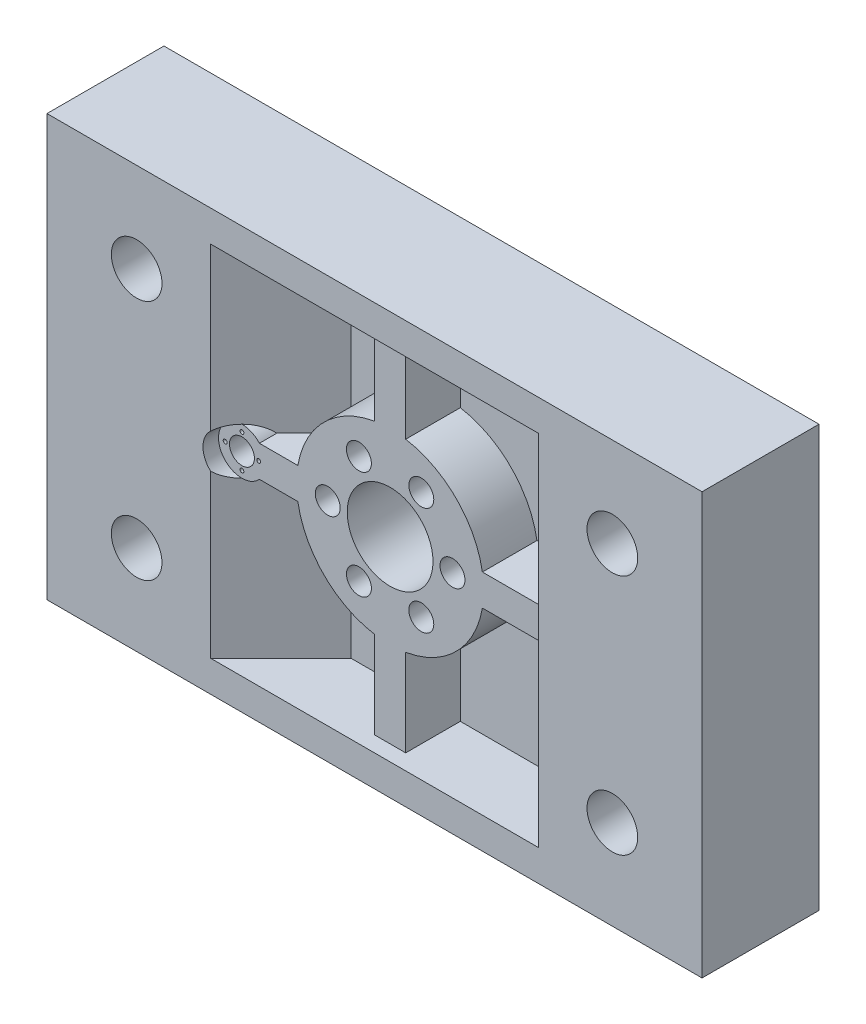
ISO-10303-21;
HEADER;
FILE_DESCRIPTION(('STEP AP214'),'2;1');
FILE_NAME('part.step','',(''),(''),'','','');
FILE_SCHEMA(('AUTOMOTIVE_DESIGN { 1 0 10303 214 1 1 1 1 }'));
ENDSEC;
DATA;
#1=APPLICATION_CONTEXT('core data for automotive mechanical design processes');
#2=APPLICATION_PROTOCOL_DEFINITION('international standard','automotive_design',2000,#1);
#3=PRODUCT_CONTEXT('',#1,'mechanical');
#4=PRODUCT('Part','Part','',(#3));
#5=PRODUCT_RELATED_PRODUCT_CATEGORY('part','',(#4));
#6=PRODUCT_DEFINITION_FORMATION('','',#4);
#7=PRODUCT_DEFINITION_CONTEXT('part definition',#1,'design');
#8=PRODUCT_DEFINITION('design','',#6,#7);
#9=PRODUCT_DEFINITION_SHAPE('','',#8);
#10=(LENGTH_UNIT() NAMED_UNIT(*) SI_UNIT(.MILLI.,.METRE.));
#11=(NAMED_UNIT(*) PLANE_ANGLE_UNIT() SI_UNIT($,.RADIAN.));
#12=(NAMED_UNIT(*) SI_UNIT($,.STERADIAN.) SOLID_ANGLE_UNIT());
#13=UNCERTAINTY_MEASURE_WITH_UNIT(LENGTH_MEASURE(1.E-05),#10,'distance_accuracy_value','');
#14=(GEOMETRIC_REPRESENTATION_CONTEXT(3) GLOBAL_UNCERTAINTY_ASSIGNED_CONTEXT((#13)) GLOBAL_UNIT_ASSIGNED_CONTEXT((#10,
#11,#12)) REPRESENTATION_CONTEXT('',''));
#15=CARTESIAN_POINT('',(0.,0.,0.));
#16=DIRECTION('',(0.,0.,1.));
#17=DIRECTION('',(1.,0.,0.));
#18=AXIS2_PLACEMENT_3D('',#15,#16,#17);
#19=CARTESIAN_POINT('',(0.,0.,60.));
#20=DIRECTION('',(0.,0.,-1.));
#21=DIRECTION('',(-1.,0.,0.));
#22=AXIS2_PLACEMENT_3D('',#19,#20,#21);
#23=PLANE('',#22);
#24=DIRECTION('',(-1.,0.,0.));
#25=VECTOR('',#24,1.);
#26=CARTESIAN_POINT('',(0.,-20.,60.0000000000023));
#27=LINE('',#26,#25);
#28=CARTESIAN_POINT('',(120.000000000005,-20.,59.9999999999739));
#29=VERTEX_POINT('',#28);
#30=CARTESIAN_POINT('',(118.321595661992,-20.,60.0000000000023));
#31=VERTEX_POINT('',#30);
#32=EDGE_CURVE('E367',#29,#31,#27,.T.);
#33=ORIENTED_EDGE('',*,*,#32,.T.);
#34=CARTESIAN_POINT('',(0.,0.,60.));
#35=DIRECTION('',(0.,0.,1.));
#36=DIRECTION('',(1.,0.,0.));
#37=AXIS2_PLACEMENT_3D('',#34,#35,#36);
#38=CIRCLE('',#37,120.);
#39=CARTESIAN_POINT('',(19.9999999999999,-118.321595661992,60.));
#40=VERTEX_POINT('',#39);
#41=EDGE_CURVE('E479',#40,#31,#38,.T.);
#42=ORIENTED_EDGE('',*,*,#41,.F.);
#43=DIRECTION('',(0.,1.,0.));
#44=VECTOR('',#43,1.);
#45=CARTESIAN_POINT('',(19.9999999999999,-118.321595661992,60.));
#46=LINE('',#45,#44);
#47=CARTESIAN_POINT('',(19.9999999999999,-230.,60.));
#48=VERTEX_POINT('',#47);
#49=EDGE_CURVE('E495',#48,#40,#46,.T.);
#50=ORIENTED_EDGE('',*,*,#49,.F.);
#51=DIRECTION('',(1.,0.,0.));
#52=VECTOR('',#51,1.);
#53=CARTESIAN_POINT('',(120.,-230.,60.));
#54=LINE('',#53,#52);
#55=CARTESIAN_POINT('',(120.,-230.,60.));
#56=VERTEX_POINT('',#55);
#57=EDGE_CURVE('E568',#48,#56,#54,.T.);
#58=ORIENTED_EDGE('',*,*,#57,.T.);
#59=DIRECTION('',(0.,1.,0.));
#60=VECTOR('',#59,1.);
#61=CARTESIAN_POINT('',(120.,230.,60.));
#62=LINE('',#61,#60);
#63=EDGE_CURVE('E574',#56,#29,#62,.T.);
#64=ORIENTED_EDGE('',*,*,#63,.T.);
#65=EDGE_LOOP('',(#33,#42,#50,#58,#64));
#66=FACE_BOUND('',#65,.T.);
#67=ADVANCED_FACE('F63',(#66),#23,.F.);
#68=CARTESIAN_POINT('',(120.,-357.279220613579,60.));
#69=DIRECTION('',(-0.707106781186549,0.,0.707106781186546));
#70=DIRECTION('',(0.707106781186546,0.,0.707106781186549));
#71=AXIS2_PLACEMENT_3D('',#68,#69,#70);
#72=PLANE('',#71);
#73=DIRECTION('',(0.,-1.,0.));
#74=VECTOR('',#73,1.);
#75=CARTESIAN_POINT('',(190.,0.,130.));
#76=LINE('',#75,#74);
#77=CARTESIAN_POINT('',(190.,19.9999999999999,130.));
#78=VERTEX_POINT('',#77);
#79=CARTESIAN_POINT('',(190.,-20.,130.));
#80=VERTEX_POINT('',#79);
#81=EDGE_CURVE('E378',#78,#80,#76,.T.);
#82=ORIENTED_EDGE('',*,*,#81,.T.);
#83=DIRECTION('',(0.707106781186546,0.,0.707106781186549));
#84=VECTOR('',#83,1.);
#85=CARTESIAN_POINT('',(-249970.,-20.0000000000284,-250030.000000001));
#86=LINE('',#85,#84);
#87=EDGE_CURVE('E361',#29,#80,#86,.T.);
#88=ORIENTED_EDGE('',*,*,#87,.F.);
#89=ORIENTED_EDGE('',*,*,#63,.F.);
#90=DIRECTION('',(0.707106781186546,0.,0.707106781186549));
#91=VECTOR('',#90,1.);
#92=CARTESIAN_POINT('',(120.,-230.,60.));
#93=LINE('',#92,#91);
#94=CARTESIAN_POINT('',(210.,-230.,150.));
#95=VERTEX_POINT('',#94);
#96=EDGE_CURVE('E559',#56,#95,#93,.T.);
#97=ORIENTED_EDGE('',*,*,#96,.T.);
#98=DIRECTION('',(0.,1.,0.));
#99=VECTOR('',#98,1.);
#100=CARTESIAN_POINT('',(210.,-357.279220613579,150.));
#101=LINE('',#100,#99);
#102=CARTESIAN_POINT('',(210.,230.,150.));
#103=VERTEX_POINT('',#102);
#104=EDGE_CURVE('E558',#95,#103,#101,.T.);
#105=ORIENTED_EDGE('',*,*,#104,.T.);
#106=DIRECTION('',(0.707106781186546,0.,0.707106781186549));
#107=VECTOR('',#106,1.);
#108=CARTESIAN_POINT('',(120.,230.,60.));
#109=LINE('',#108,#107);
#110=CARTESIAN_POINT('',(120.,230.,60.));
#111=VERTEX_POINT('',#110);
#112=EDGE_CURVE('E553',#111,#103,#109,.T.);
#113=ORIENTED_EDGE('',*,*,#112,.F.);
#114=CARTESIAN_POINT('',(120.,19.9999999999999,60.0000000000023));
#115=VERTEX_POINT('',#114);
#116=EDGE_CURVE('E573',#115,#111,#62,.T.);
#117=ORIENTED_EDGE('',*,*,#116,.F.);
#118=DIRECTION('',(0.707106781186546,0.,0.707106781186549));
#119=VECTOR('',#118,1.);
#120=CARTESIAN_POINT('',(-249970.,19.9999999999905,-250030.000000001));
#121=LINE('',#120,#119);
#122=EDGE_CURVE('E385',#115,#78,#121,.T.);
#123=ORIENTED_EDGE('',*,*,#122,.T.);
#124=EDGE_LOOP('',(#82,#88,#89,#97,#105,#113,#117,#123));
#125=FACE_BOUND('',#124,.T.);
#126=ADVANCED_FACE('F383',(#125),#72,.T.);
#127=CARTESIAN_POINT('',(0.,0.,130.));
#128=DIRECTION('',(0.,0.,-1.));
#129=DIRECTION('',(-1.,0.,0.));
#130=AXIS2_PLACEMENT_3D('',#127,#128,#129);
#131=CYLINDRICAL_SURFACE('',#130,120.);
#132=DIRECTION('',(0.,0.,1.));
#133=VECTOR('',#132,1.);
#134=CARTESIAN_POINT('',(118.321595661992,-20.,-500000.));
#135=LINE('',#134,#133);
#136=CARTESIAN_POINT('',(118.321595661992,-20.,130.));
#137=VERTEX_POINT('',#136);
#138=EDGE_CURVE('E977',#31,#137,#135,.T.);
#139=ORIENTED_EDGE('',*,*,#138,.T.);
#140=CARTESIAN_POINT('',(0.,0.,130.));
#141=DIRECTION('',(0.,0.,1.));
#142=DIRECTION('',(1.,0.,0.));
#143=AXIS2_PLACEMENT_3D('',#140,#141,#142);
#144=CIRCLE('',#143,120.);
#145=CARTESIAN_POINT('',(19.9999999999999,-118.321595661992,130.));
#146=VERTEX_POINT('',#145);
#147=EDGE_CURVE('E380',#146,#137,#144,.T.);
#148=ORIENTED_EDGE('',*,*,#147,.F.);
#149=DIRECTION('',(0.,0.,-1.));
#150=VECTOR('',#149,1.);
#151=CARTESIAN_POINT('',(19.9999999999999,-118.321595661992,130.));
#152=LINE('',#151,#150);
#153=EDGE_CURVE('E478',#146,#40,#152,.T.);
#154=ORIENTED_EDGE('',*,*,#153,.T.);
#155=ORIENTED_EDGE('',*,*,#41,.T.);
#156=EDGE_LOOP('',(#139,#148,#154,#155));
#157=FACE_BOUND('',#156,.T.);
#158=ADVANCED_FACE('F902',(#157),#131,.T.);
#159=DIRECTION('',(-1.,0.,0.));
#160=VECTOR('',#159,1.);
#161=CARTESIAN_POINT('',(0.,-20.0000000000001,60.0000000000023));
#162=LINE('',#161,#160);
#163=CARTESIAN_POINT('',(-118.321595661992,-20.0000000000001,60.0000000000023));
#164=VERTEX_POINT('',#163);
#165=CARTESIAN_POINT('',(-120.000000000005,-20.0000000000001,60.0000000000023));
#166=VERTEX_POINT('',#165);
#167=EDGE_CURVE('E411',#164,#166,#162,.T.);
#168=ORIENTED_EDGE('',*,*,#167,.T.);
#169=DIRECTION('',(0.,-1.,0.));
#170=VECTOR('',#169,1.);
#171=CARTESIAN_POINT('',(-120.,230.,60.));
#172=LINE('',#171,#170);
#173=CARTESIAN_POINT('',(-120.,-230.,60.));
#174=VERTEX_POINT('',#173);
#175=EDGE_CURVE('E569',#166,#174,#172,.T.);
#176=ORIENTED_EDGE('',*,*,#175,.T.);
#177=CARTESIAN_POINT('',(-20.,-230.,60.));
#178=VERTEX_POINT('',#177);
#179=EDGE_CURVE('E570',#174,#178,#54,.T.);
#180=ORIENTED_EDGE('',*,*,#179,.T.);
#181=DIRECTION('',(0.,-1.,0.));
#182=VECTOR('',#181,1.);
#183=CARTESIAN_POINT('',(-20.,-118.321595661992,60.));
#184=LINE('',#183,#182);
#185=CARTESIAN_POINT('',(-20.,-118.321595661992,60.));
#186=VERTEX_POINT('',#185);
#187=EDGE_CURVE('E492',#186,#178,#184,.T.);
#188=ORIENTED_EDGE('',*,*,#187,.F.);
#189=CARTESIAN_POINT('',(0.,0.,60.));
#190=DIRECTION('',(0.,0.,1.));
#191=DIRECTION('',(1.,0.,0.));
#192=AXIS2_PLACEMENT_3D('',#189,#190,#191);
#193=CIRCLE('',#192,120.);
#194=EDGE_CURVE('E488',#164,#186,#193,.T.);
#195=ORIENTED_EDGE('',*,*,#194,.F.);
#196=EDGE_LOOP('',(#168,#176,#180,#188,#195));
#197=FACE_BOUND('',#196,.T.);
#198=ADVANCED_FACE('F897',(#197),#23,.F.);
#199=CARTESIAN_POINT('',(-120.,-357.279220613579,60.));
#200=DIRECTION('',(0.707106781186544,0.,0.707106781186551));
#201=DIRECTION('',(0.707106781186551,0.,-0.707106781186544));
#202=AXIS2_PLACEMENT_3D('',#199,#200,#201);
#203=PLANE('',#202);
#204=ORIENTED_EDGE('',*,*,#175,.F.);
#205=DIRECTION('',(0.707106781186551,0.,-0.707106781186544));
#206=VECTOR('',#205,1.);
#207=CARTESIAN_POINT('',(249970.,-19.9999999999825,-250029.999999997));
#208=LINE('',#207,#206);
#209=CARTESIAN_POINT('',(-167.639320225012,-20.0000000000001,107.639320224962));
#210=VERTEX_POINT('',#209);
#211=EDGE_CURVE('E406',#210,#166,#208,.T.);
#212=ORIENTED_EDGE('',*,*,#211,.F.);
#213=CARTESIAN_POINT('',(-190.,0.,129.999999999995));
#214=DIRECTION('',(0.707106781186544,0.,0.707106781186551));
#215=DIRECTION('',(-0.707106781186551,0.,0.707106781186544));
#216=AXIS2_PLACEMENT_3D('',#213,#214,#215);
#217=ELLIPSE('',#216,42.4264068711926,30.);
#218=CARTESIAN_POINT('',(-190.000000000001,-30.,130.));
#219=VERTEX_POINT('',#218);
#220=EDGE_CURVE('E519',#210,#219,#217,.F.);
#221=ORIENTED_EDGE('',*,*,#220,.T.);
#222=CARTESIAN_POINT('',(-190.,0.,129.999999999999));
#223=DIRECTION('',(0.707106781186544,0.,0.707106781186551));
#224=DIRECTION('',(-0.707106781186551,0.,0.707106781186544));
#225=AXIS2_PLACEMENT_3D('',#222,#223,#224);
#226=ELLIPSE('',#225,42.4264068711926,30.);
#227=CARTESIAN_POINT('',(-210.000000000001,-22.360679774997,150.));
#228=VERTEX_POINT('',#227);
#229=EDGE_CURVE('E72',#228,#219,#226,.T.);
#230=ORIENTED_EDGE('',*,*,#229,.F.);
#231=DIRECTION('',(0.,1.,0.));
#232=VECTOR('',#231,1.);
#233=CARTESIAN_POINT('',(-210.000000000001,-357.279220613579,150.));
#234=LINE('',#233,#232);
#235=CARTESIAN_POINT('',(-210.000000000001,-230.,150.));
#236=VERTEX_POINT('',#235);
#237=EDGE_CURVE('E550',#236,#228,#234,.T.);
#238=ORIENTED_EDGE('',*,*,#237,.F.);
#239=DIRECTION('',(0.707106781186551,0.,-0.707106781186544));
#240=VECTOR('',#239,1.);
#241=CARTESIAN_POINT('',(-120.,-230.,60.));
#242=LINE('',#241,#240);
#243=EDGE_CURVE('E549',#236,#174,#242,.T.);
#244=ORIENTED_EDGE('',*,*,#243,.T.);
#245=EDGE_LOOP('',(#204,#212,#221,#230,#238,#244));
#246=FACE_BOUND('',#245,.T.);
#247=ADVANCED_FACE('F906',(#246),#203,.T.);
#248=CARTESIAN_POINT('',(-190.,0.,-500000.));
#249=DIRECTION('',(0.,0.,1.));
#250=DIRECTION('',(1.,0.,0.));
#251=AXIS2_PLACEMENT_3D('',#248,#249,#250);
#252=CYLINDRICAL_SURFACE('',#251,30.);
#253=ORIENTED_EDGE('',*,*,#220,.F.);
#254=DIRECTION('',(0.,0.,1.));
#255=VECTOR('',#254,1.);
#256=CARTESIAN_POINT('',(-167.639320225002,-20.0000000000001,-500000.));
#257=LINE('',#256,#255);
#258=CARTESIAN_POINT('',(-167.639320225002,-20.0000000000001,130.));
#259=VERTEX_POINT('',#258);
#260=EDGE_CURVE('E401',#210,#259,#257,.T.);
#261=ORIENTED_EDGE('',*,*,#260,.T.);
#262=CARTESIAN_POINT('',(-190.,0.,130.));
#263=DIRECTION('',(0.,0.,1.));
#264=DIRECTION('',(1.,0.,0.));
#265=AXIS2_PLACEMENT_3D('',#262,#263,#264);
#266=CIRCLE('',#265,30.);
#267=EDGE_CURVE('E520',#219,#259,#266,.T.);
#268=ORIENTED_EDGE('',*,*,#267,.F.);
#269=EDGE_LOOP('',(#253,#261,#268));
#270=FACE_BOUND('',#269,.T.);
#271=ADVANCED_FACE('F950',(#270),#252,.T.);
#272=CARTESIAN_POINT('',(0.,0.,130.));
#273=DIRECTION('',(0.,0.,-1.));
#274=DIRECTION('',(-1.,0.,0.));
#275=AXIS2_PLACEMENT_3D('',#272,#273,#274);
#276=CYLINDRICAL_SURFACE('',#275,120.);
#277=DIRECTION('',(0.,0.,1.));
#278=VECTOR('',#277,1.);
#279=CARTESIAN_POINT('',(-118.321595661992,-20.0000000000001,-500000.));
#280=LINE('',#279,#278);
#281=CARTESIAN_POINT('',(-118.321595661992,-20.0000000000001,130.));
#282=VERTEX_POINT('',#281);
#283=EDGE_CURVE('E399',#164,#282,#280,.T.);
#284=ORIENTED_EDGE('',*,*,#283,.F.);
#285=ORIENTED_EDGE('',*,*,#194,.T.);
#286=DIRECTION('',(0.,0.,-1.));
#287=VECTOR('',#286,1.);
#288=CARTESIAN_POINT('',(-20.,-118.321595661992,130.));
#289=LINE('',#288,#287);
#290=CARTESIAN_POINT('',(-20.,-118.321595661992,130.));
#291=VERTEX_POINT('',#290);
#292=EDGE_CURVE('E505',#291,#186,#289,.T.);
#293=ORIENTED_EDGE('',*,*,#292,.F.);
#294=CARTESIAN_POINT('',(0.,0.,130.));
#295=DIRECTION('',(0.,0.,1.));
#296=DIRECTION('',(1.,0.,0.));
#297=AXIS2_PLACEMENT_3D('',#294,#295,#296);
#298=CIRCLE('',#297,120.);
#299=EDGE_CURVE('E466',#282,#291,#298,.T.);
#300=ORIENTED_EDGE('',*,*,#299,.F.);
#301=EDGE_LOOP('',(#284,#285,#293,#300));
#302=FACE_BOUND('',#301,.T.);
#303=ADVANCED_FACE('F998',(#302),#276,.T.);
#304=CARTESIAN_POINT('',(79.9999999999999,0.,150.));
#305=DIRECTION('',(0.,0.,-1.));
#306=DIRECTION('',(-1.,0.,0.));
#307=AXIS2_PLACEMENT_3D('',#304,#305,#306);
#308=CYLINDRICAL_SURFACE('',#307,11.);
#309=CARTESIAN_POINT('',(79.9999999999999,0.,0.));
#310=DIRECTION('',(0.,0.,1.));
#311=DIRECTION('',(1.,0.,0.));
#312=AXIS2_PLACEMENT_3D('',#309,#310,#311);
#313=CIRCLE('',#312,11.);
#314=CARTESIAN_POINT('',(90.9999999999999,0.,0.));
#315=VERTEX_POINT('',#314);
#316=EDGE_CURVE('E771',#315,#315,#313,.T.);
#317=ORIENTED_EDGE('',*,*,#316,.F.);
#318=EDGE_LOOP('',(#317));
#319=FACE_BOUND('',#318,.T.);
#320=CARTESIAN_POINT('',(79.9999999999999,0.,105.));
#321=DIRECTION('',(0.,0.,1.));
#322=DIRECTION('',(1.,0.,0.));
#323=AXIS2_PLACEMENT_3D('',#320,#321,#322);
#324=CIRCLE('',#323,11.);
#325=CARTESIAN_POINT('',(90.9999999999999,0.,105.));
#326=VERTEX_POINT('',#325);
#327=EDGE_CURVE('E67',#326,#326,#324,.T.);
#328=ORIENTED_EDGE('',*,*,#327,.T.);
#329=EDGE_LOOP('',(#328));
#330=FACE_BOUND('',#329,.T.);
#331=ADVANCED_FACE('F848',(#319,#330),#308,.F.);
#332=CARTESIAN_POINT('',(39.9999999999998,-69.2820323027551,150.));
#333=DIRECTION('',(0.,0.,-1.));
#334=DIRECTION('',(-1.,0.,0.));
#335=AXIS2_PLACEMENT_3D('',#332,#333,#334);
#336=CYLINDRICAL_SURFACE('',#335,11.);
#337=CARTESIAN_POINT('',(39.9999999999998,-69.2820323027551,0.));
#338=DIRECTION('',(0.,0.,1.));
#339=DIRECTION('',(1.,0.,0.));
#340=AXIS2_PLACEMENT_3D('',#337,#338,#339);
#341=CIRCLE('',#340,11.);
#342=CARTESIAN_POINT('',(50.9999999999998,-69.2820323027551,0.));
#343=VERTEX_POINT('',#342);
#344=EDGE_CURVE('E765',#343,#343,#341,.T.);
#345=ORIENTED_EDGE('',*,*,#344,.F.);
#346=EDGE_LOOP('',(#345));
#347=FACE_BOUND('',#346,.T.);
#348=CARTESIAN_POINT('',(39.9999999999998,-69.2820323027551,105.));
#349=DIRECTION('',(0.,0.,1.));
#350=DIRECTION('',(1.,0.,0.));
#351=AXIS2_PLACEMENT_3D('',#348,#349,#350);
#352=CIRCLE('',#351,11.);
#353=CARTESIAN_POINT('',(50.9999999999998,-69.2820323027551,105.));
#354=VERTEX_POINT('',#353);
#355=EDGE_CURVE('E841',#354,#354,#352,.T.);
#356=ORIENTED_EDGE('',*,*,#355,.T.);
#357=EDGE_LOOP('',(#356));
#358=FACE_BOUND('',#357,.T.);
#359=ADVANCED_FACE('F1005',(#347,#358),#336,.F.);
#360=CARTESIAN_POINT('',(-40.0000000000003,-69.2820323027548,150.));
#361=DIRECTION('',(0.,0.,-1.));
#362=DIRECTION('',(-1.,0.,0.));
#363=AXIS2_PLACEMENT_3D('',#360,#361,#362);
#364=CYLINDRICAL_SURFACE('',#363,11.);
#365=CARTESIAN_POINT('',(-40.0000000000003,-69.2820323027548,0.));
#366=DIRECTION('',(0.,0.,1.));
#367=DIRECTION('',(1.,0.,0.));
#368=AXIS2_PLACEMENT_3D('',#365,#366,#367);
#369=CIRCLE('',#368,11.);
#370=CARTESIAN_POINT('',(-29.0000000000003,-69.2820323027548,0.));
#371=VERTEX_POINT('',#370);
#372=EDGE_CURVE('E762',#371,#371,#369,.T.);
#373=ORIENTED_EDGE('',*,*,#372,.F.);
#374=EDGE_LOOP('',(#373));
#375=FACE_BOUND('',#374,.T.);
#376=CARTESIAN_POINT('',(-40.0000000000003,-69.2820323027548,105.));
#377=DIRECTION('',(0.,0.,1.));
#378=DIRECTION('',(1.,0.,0.));
#379=AXIS2_PLACEMENT_3D('',#376,#377,#378);
#380=CIRCLE('',#379,11.);
#381=CARTESIAN_POINT('',(-29.0000000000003,-69.2820323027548,105.));
#382=VERTEX_POINT('',#381);
#383=EDGE_CURVE('E839',#382,#382,#380,.T.);
#384=ORIENTED_EDGE('',*,*,#383,.T.);
#385=EDGE_LOOP('',(#384));
#386=FACE_BOUND('',#385,.T.);
#387=ADVANCED_FACE('F1726',(#375,#386),#364,.F.);
#388=CARTESIAN_POINT('',(-79.9999999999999,5.58637014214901E-13,150.));
#389=DIRECTION('',(0.,0.,-1.));
#390=DIRECTION('',(-1.,0.,0.));
#391=AXIS2_PLACEMENT_3D('',#388,#389,#390);
#392=CYLINDRICAL_SURFACE('',#391,11.);
#393=CARTESIAN_POINT('',(-79.9999999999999,5.58637014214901E-13,0.));
#394=DIRECTION('',(0.,0.,1.));
#395=DIRECTION('',(1.,0.,0.));
#396=AXIS2_PLACEMENT_3D('',#393,#394,#395);
#397=CIRCLE('',#396,11.);
#398=CARTESIAN_POINT('',(-68.9999999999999,5.58637014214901E-13,0.));
#399=VERTEX_POINT('',#398);
#400=EDGE_CURVE('E759',#399,#399,#397,.T.);
#401=ORIENTED_EDGE('',*,*,#400,.F.);
#402=EDGE_LOOP('',(#401));
#403=FACE_BOUND('',#402,.T.);
#404=CARTESIAN_POINT('',(-79.9999999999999,5.58637014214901E-13,105.));
#405=DIRECTION('',(0.,0.,1.));
#406=DIRECTION('',(1.,0.,0.));
#407=AXIS2_PLACEMENT_3D('',#404,#405,#406);
#408=CIRCLE('',#407,11.);
#409=CARTESIAN_POINT('',(-68.9999999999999,5.58637014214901E-13,105.));
#410=VERTEX_POINT('',#409);
#411=EDGE_CURVE('E836',#410,#410,#408,.T.);
#412=ORIENTED_EDGE('',*,*,#411,.T.);
#413=EDGE_LOOP('',(#412));
#414=FACE_BOUND('',#413,.T.);
#415=ADVANCED_FACE('F1731',(#403,#414),#392,.F.);
#416=CARTESIAN_POINT('',(40.0000000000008,69.2820323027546,150.));
#417=DIRECTION('',(0.,0.,-1.));
#418=DIRECTION('',(-1.,0.,0.));
#419=AXIS2_PLACEMENT_3D('',#416,#417,#418);
#420=CYLINDRICAL_SURFACE('',#419,11.);
#421=CARTESIAN_POINT('',(40.0000000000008,69.2820323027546,0.));
#422=DIRECTION('',(0.,0.,1.));
#423=DIRECTION('',(1.,0.,0.));
#424=AXIS2_PLACEMENT_3D('',#421,#422,#423);
#425=CIRCLE('',#424,11.);
#426=CARTESIAN_POINT('',(51.0000000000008,69.2820323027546,0.));
#427=VERTEX_POINT('',#426);
#428=EDGE_CURVE('E753',#427,#427,#425,.T.);
#429=ORIENTED_EDGE('',*,*,#428,.F.);
#430=EDGE_LOOP('',(#429));
#431=FACE_BOUND('',#430,.T.);
#432=CARTESIAN_POINT('',(40.0000000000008,69.2820323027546,105.));
#433=DIRECTION('',(0.,0.,1.));
#434=DIRECTION('',(1.,0.,0.));
#435=AXIS2_PLACEMENT_3D('',#432,#433,#434);
#436=CIRCLE('',#435,11.);
#437=CARTESIAN_POINT('',(51.0000000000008,69.2820323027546,105.));
#438=VERTEX_POINT('',#437);
#439=EDGE_CURVE('E436',#438,#438,#436,.T.);
#440=ORIENTED_EDGE('',*,*,#439,.T.);
#441=EDGE_LOOP('',(#440));
#442=FACE_BOUND('',#441,.T.);
#443=ADVANCED_FACE('F1737',(#431,#442),#420,.F.);
#444=CARTESIAN_POINT('',(-39.9999999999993,69.2820323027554,150.));
#445=DIRECTION('',(0.,0.,-1.));
#446=DIRECTION('',(-1.,0.,0.));
#447=AXIS2_PLACEMENT_3D('',#444,#445,#446);
#448=CYLINDRICAL_SURFACE('',#447,11.);
#449=CARTESIAN_POINT('',(-39.9999999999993,69.2820323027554,0.));
#450=DIRECTION('',(0.,0.,1.));
#451=DIRECTION('',(1.,0.,0.));
#452=AXIS2_PLACEMENT_3D('',#449,#450,#451);
#453=CIRCLE('',#452,11.);
#454=CARTESIAN_POINT('',(-28.9999999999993,69.2820323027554,0.));
#455=VERTEX_POINT('',#454);
#456=EDGE_CURVE('E756',#455,#455,#453,.T.);
#457=ORIENTED_EDGE('',*,*,#456,.F.);
#458=EDGE_LOOP('',(#457));
#459=FACE_BOUND('',#458,.T.);
#460=CARTESIAN_POINT('',(-39.9999999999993,69.2820323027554,105.));
#461=DIRECTION('',(0.,0.,1.));
#462=DIRECTION('',(1.,0.,0.));
#463=AXIS2_PLACEMENT_3D('',#460,#461,#462);
#464=CIRCLE('',#463,11.);
#465=CARTESIAN_POINT('',(-28.9999999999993,69.2820323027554,105.));
#466=VERTEX_POINT('',#465);
#467=EDGE_CURVE('E448',#466,#466,#464,.T.);
#468=ORIENTED_EDGE('',*,*,#467,.T.);
#469=EDGE_LOOP('',(#468));
#470=FACE_BOUND('',#469,.T.);
#471=ADVANCED_FACE('F1739',(#459,#470),#448,.F.);
#472=CARTESIAN_POINT('',(120.,230.,60.));
#473=DIRECTION('',(0.,1.,0.));
#474=DIRECTION('',(0.,0.,1.));
#475=AXIS2_PLACEMENT_3D('',#472,#473,#474);
#476=PLANE('',#475);
#477=DIRECTION('',(0.,0.,-1.));
#478=VECTOR('',#477,1.);
#479=CARTESIAN_POINT('',(19.9999999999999,230.,130.));
#480=LINE('',#479,#478);
#481=CARTESIAN_POINT('',(19.9999999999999,230.,130.));
#482=VERTEX_POINT('',#481);
#483=CARTESIAN_POINT('',(19.9999999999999,230.,60.));
#484=VERTEX_POINT('',#483);
#485=EDGE_CURVE('E514',#482,#484,#480,.T.);
#486=ORIENTED_EDGE('',*,*,#485,.T.);
#487=DIRECTION('',(-1.,0.,0.));
#488=VECTOR('',#487,1.);
#489=CARTESIAN_POINT('',(120.,230.,60.));
#490=LINE('',#489,#488);
#491=EDGE_CURVE('E577',#111,#484,#490,.T.);
#492=ORIENTED_EDGE('',*,*,#491,.F.);
#493=ORIENTED_EDGE('',*,*,#112,.T.);
#494=DIRECTION('',(-1.,0.,0.));
#495=VECTOR('',#494,1.);
#496=CARTESIAN_POINT('',(120.,230.,150.));
#497=LINE('',#496,#495);
#498=CARTESIAN_POINT('',(-210.000000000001,230.,150.));
#499=VERTEX_POINT('',#498);
#500=EDGE_CURVE('E582',#103,#499,#497,.T.);
#501=ORIENTED_EDGE('',*,*,#500,.T.);
#502=DIRECTION('',(0.707106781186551,0.,-0.707106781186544));
#503=VECTOR('',#502,1.);
#504=CARTESIAN_POINT('',(-120.,230.,60.));
#505=LINE('',#504,#503);
#506=CARTESIAN_POINT('',(-120.,230.,60.));
#507=VERTEX_POINT('',#506);
#508=EDGE_CURVE('E546',#499,#507,#505,.T.);
#509=ORIENTED_EDGE('',*,*,#508,.T.);
#510=CARTESIAN_POINT('',(-20.,230.,60.));
#511=VERTEX_POINT('',#510);
#512=EDGE_CURVE('E576',#511,#507,#490,.T.);
#513=ORIENTED_EDGE('',*,*,#512,.F.);
#514=DIRECTION('',(0.,0.,-1.));
#515=VECTOR('',#514,1.);
#516=CARTESIAN_POINT('',(-20.0000000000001,230.,130.));
#517=LINE('',#516,#515);
#518=CARTESIAN_POINT('',(-20.,230.,130.));
#519=VERTEX_POINT('',#518);
#520=EDGE_CURVE('E511',#519,#511,#517,.T.);
#521=ORIENTED_EDGE('',*,*,#520,.F.);
#522=DIRECTION('',(-1.,0.,0.));
#523=VECTOR('',#522,1.);
#524=CARTESIAN_POINT('',(19.9999999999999,230.,130.));
#525=LINE('',#524,#523);
#526=EDGE_CURVE('E461',#482,#519,#525,.T.);
#527=ORIENTED_EDGE('',*,*,#526,.F.);
#528=EDGE_LOOP('',(#486,#492,#493,#501,#509,#513,#521,#527));
#529=FACE_BOUND('',#528,.T.);
#530=ADVANCED_FACE('F918',(#529),#476,.F.);
#531=CARTESIAN_POINT('',(120.,-230.,60.));
#532=DIRECTION('',(0.,-1.,0.));
#533=DIRECTION('',(1.,0.,0.));
#534=AXIS2_PLACEMENT_3D('',#531,#532,#533);
#535=PLANE('',#534);
#536=DIRECTION('',(0.,0.,-1.));
#537=VECTOR('',#536,1.);
#538=CARTESIAN_POINT('',(-20.,-230.,130.));
#539=LINE('',#538,#537);
#540=CARTESIAN_POINT('',(-20.,-230.,130.));
#541=VERTEX_POINT('',#540);
#542=EDGE_CURVE('E503',#541,#178,#539,.T.);
#543=ORIENTED_EDGE('',*,*,#542,.T.);
#544=ORIENTED_EDGE('',*,*,#179,.F.);
#545=ORIENTED_EDGE('',*,*,#243,.F.);
#546=DIRECTION('',(1.,0.,0.));
#547=VECTOR('',#546,1.);
#548=CARTESIAN_POINT('',(120.,-230.,150.));
#549=LINE('',#548,#547);
#550=EDGE_CURVE('E562',#236,#95,#549,.T.);
#551=ORIENTED_EDGE('',*,*,#550,.T.);
#552=ORIENTED_EDGE('',*,*,#96,.F.);
#553=ORIENTED_EDGE('',*,*,#57,.F.);
#554=DIRECTION('',(0.,0.,-1.));
#555=VECTOR('',#554,1.);
#556=CARTESIAN_POINT('',(19.9999999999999,-230.,130.));
#557=LINE('',#556,#555);
#558=CARTESIAN_POINT('',(19.9999999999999,-230.,130.));
#559=VERTEX_POINT('',#558);
#560=EDGE_CURVE('E500',#559,#48,#557,.T.);
#561=ORIENTED_EDGE('',*,*,#560,.F.);
#562=DIRECTION('',(1.,0.,0.));
#563=VECTOR('',#562,1.);
#564=CARTESIAN_POINT('',(-20.,-230.,130.));
#565=LINE('',#564,#563);
#566=EDGE_CURVE('E473',#541,#559,#565,.T.);
#567=ORIENTED_EDGE('',*,*,#566,.F.);
#568=EDGE_LOOP('',(#543,#544,#545,#551,#552,#553,#561,#567));
#569=FACE_BOUND('',#568,.T.);
#570=ADVANCED_FACE('F910',(#569),#535,.F.);
#571=CARTESIAN_POINT('',(-120.,19.9999999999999,60.0000000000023));
#572=VERTEX_POINT('',#571);
#573=EDGE_CURVE('E565',#507,#572,#172,.T.);
#574=ORIENTED_EDGE('',*,*,#573,.T.);
#575=DIRECTION('',(-1.,0.,0.));
#576=VECTOR('',#575,1.);
#577=CARTESIAN_POINT('',(0.,19.9999999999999,60.0000000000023));
#578=LINE('',#577,#576);
#579=CARTESIAN_POINT('',(-118.321595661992,19.9999999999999,60.0000000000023));
#580=VERTEX_POINT('',#579);
#581=EDGE_CURVE('E404',#580,#572,#578,.T.);
#582=ORIENTED_EDGE('',*,*,#581,.F.);
#583=CARTESIAN_POINT('',(-20.,118.321595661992,60.));
#584=VERTEX_POINT('',#583);
#585=EDGE_CURVE('E489',#584,#580,#193,.T.);
#586=ORIENTED_EDGE('',*,*,#585,.F.);
#587=DIRECTION('',(0.,-1.,0.));
#588=VECTOR('',#587,1.);
#589=CARTESIAN_POINT('',(-20.0000000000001,230.,60.));
#590=LINE('',#589,#588);
#591=EDGE_CURVE('E485',#511,#584,#590,.T.);
#592=ORIENTED_EDGE('',*,*,#591,.F.);
#593=ORIENTED_EDGE('',*,*,#512,.T.);
#594=EDGE_LOOP('',(#574,#582,#586,#592,#593));
#595=FACE_BOUND('',#594,.T.);
#596=ADVANCED_FACE('F898',(#595),#23,.F.);
#597=CARTESIAN_POINT('',(118.321595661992,19.9999999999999,60.0000000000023));
#598=VERTEX_POINT('',#597);
#599=CARTESIAN_POINT('',(19.9999999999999,118.321595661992,60.));
#600=VERTEX_POINT('',#599);
#601=EDGE_CURVE('E455',#598,#600,#38,.T.);
#602=ORIENTED_EDGE('',*,*,#601,.F.);
#603=DIRECTION('',(-1.,0.,0.));
#604=VECTOR('',#603,1.);
#605=CARTESIAN_POINT('',(0.,19.9999999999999,60.0000000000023));
#606=LINE('',#605,#604);
#607=EDGE_CURVE('E372',#115,#598,#606,.T.);
#608=ORIENTED_EDGE('',*,*,#607,.F.);
#609=ORIENTED_EDGE('',*,*,#116,.T.);
#610=ORIENTED_EDGE('',*,*,#491,.T.);
#611=DIRECTION('',(0.,1.,0.));
#612=VECTOR('',#611,1.);
#613=CARTESIAN_POINT('',(19.9999999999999,230.,60.));
#614=LINE('',#613,#612);
#615=EDGE_CURVE('E482',#600,#484,#614,.T.);
#616=ORIENTED_EDGE('',*,*,#615,.F.);
#617=EDGE_LOOP('',(#602,#608,#609,#610,#616));
#618=FACE_BOUND('',#617,.T.);
#619=ADVANCED_FACE('F908',(#618),#23,.F.);
#620=CARTESIAN_POINT('',(-190.,0.,150.));
#621=DIRECTION('',(0.,0.,-1.));
#622=DIRECTION('',(-1.,0.,0.));
#623=AXIS2_PLACEMENT_3D('',#620,#621,#622);
#624=CYLINDRICAL_SURFACE('',#623,16.);
#625=CARTESIAN_POINT('',(-190.,0.,0.));
#626=DIRECTION('',(0.,0.,1.));
#627=DIRECTION('',(1.,0.,0.));
#628=AXIS2_PLACEMENT_3D('',#625,#626,#627);
#629=CIRCLE('',#628,16.);
#630=CARTESIAN_POINT('',(-174.,0.,0.));
#631=VERTEX_POINT('',#630);
#632=EDGE_CURVE('E786',#631,#631,#629,.T.);
#633=ORIENTED_EDGE('',*,*,#632,.F.);
#634=EDGE_LOOP('',(#633));
#635=FACE_BOUND('',#634,.T.);
#636=CARTESIAN_POINT('',(-190.,0.,130.));
#637=DIRECTION('',(0.,0.,1.));
#638=DIRECTION('',(1.,0.,0.));
#639=AXIS2_PLACEMENT_3D('',#636,#637,#638);
#640=CIRCLE('',#639,16.);
#641=CARTESIAN_POINT('',(-174.,0.,130.));
#642=VERTEX_POINT('',#641);
#643=EDGE_CURVE('E536',#642,#642,#640,.T.);
#644=ORIENTED_EDGE('',*,*,#643,.T.);
#645=EDGE_LOOP('',(#644));
#646=FACE_BOUND('',#645,.T.);
#647=ADVANCED_FACE('F916',(#635,#646),#624,.F.);
#648=CARTESIAN_POINT('',(-211.5,0.,150.));
#649=DIRECTION('',(0.,0.,-1.));
#650=DIRECTION('',(-1.,0.,0.));
#651=AXIS2_PLACEMENT_3D('',#648,#649,#650);
#652=CYLINDRICAL_SURFACE('',#651,2.5);
#653=CARTESIAN_POINT('',(-211.5,0.,0.));
#654=DIRECTION('',(0.,0.,1.));
#655=DIRECTION('',(1.,0.,0.));
#656=AXIS2_PLACEMENT_3D('',#653,#654,#655);
#657=CIRCLE('',#656,2.5);
#658=CARTESIAN_POINT('',(-209.,0.,0.));
#659=VERTEX_POINT('',#658);
#660=EDGE_CURVE('E783',#659,#659,#657,.T.);
#661=ORIENTED_EDGE('',*,*,#660,.F.);
#662=EDGE_LOOP('',(#661));
#663=FACE_BOUND('',#662,.T.);
#664=CARTESIAN_POINT('',(-211.5,0.,130.));
#665=DIRECTION('',(0.,0.,1.));
#666=DIRECTION('',(1.,0.,0.));
#667=AXIS2_PLACEMENT_3D('',#664,#665,#666);
#668=CIRCLE('',#667,2.5);
#669=CARTESIAN_POINT('',(-209.,0.,130.));
#670=VERTEX_POINT('',#669);
#671=EDGE_CURVE('E542',#670,#670,#668,.T.);
#672=ORIENTED_EDGE('',*,*,#671,.T.);
#673=EDGE_LOOP('',(#672));
#674=FACE_BOUND('',#673,.T.);
#675=ADVANCED_FACE('F1300',(#663,#674),#652,.F.);
#676=CARTESIAN_POINT('',(-190.,-21.5,150.));
#677=DIRECTION('',(0.,0.,-1.));
#678=DIRECTION('',(-1.,0.,0.));
#679=AXIS2_PLACEMENT_3D('',#676,#677,#678);
#680=CYLINDRICAL_SURFACE('',#679,2.5);
#681=CARTESIAN_POINT('',(-190.,-21.5,0.));
#682=DIRECTION('',(0.,0.,1.));
#683=DIRECTION('',(1.,0.,0.));
#684=AXIS2_PLACEMENT_3D('',#681,#682,#683);
#685=CIRCLE('',#684,2.5);
#686=CARTESIAN_POINT('',(-187.5,-21.5,0.));
#687=VERTEX_POINT('',#686);
#688=EDGE_CURVE('E780',#687,#687,#685,.T.);
#689=ORIENTED_EDGE('',*,*,#688,.F.);
#690=EDGE_LOOP('',(#689));
#691=FACE_BOUND('',#690,.T.);
#692=CARTESIAN_POINT('',(-190.,-21.5,130.));
#693=DIRECTION('',(0.,0.,1.));
#694=DIRECTION('',(1.,0.,0.));
#695=AXIS2_PLACEMENT_3D('',#692,#693,#694);
#696=CIRCLE('',#695,2.5);
#697=CARTESIAN_POINT('',(-187.5,-21.5,130.));
#698=VERTEX_POINT('',#697);
#699=EDGE_CURVE('E532',#698,#698,#696,.T.);
#700=ORIENTED_EDGE('',*,*,#699,.T.);
#701=EDGE_LOOP('',(#700));
#702=FACE_BOUND('',#701,.T.);
#703=ADVANCED_FACE('F1288',(#691,#702),#680,.F.);
#704=CARTESIAN_POINT('',(-190.,21.5,150.));
#705=DIRECTION('',(0.,0.,-1.));
#706=DIRECTION('',(-1.,0.,0.));
#707=AXIS2_PLACEMENT_3D('',#704,#705,#706);
#708=CYLINDRICAL_SURFACE('',#707,2.50000000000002);
#709=CARTESIAN_POINT('',(-190.,21.5,0.));
#710=DIRECTION('',(0.,0.,1.));
#711=DIRECTION('',(-1.,0.,0.));
#712=AXIS2_PLACEMENT_3D('',#709,#710,#711);
#713=CIRCLE('',#712,2.50000000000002);
#714=CARTESIAN_POINT('',(-192.5,21.5,0.));
#715=VERTEX_POINT('',#714);
#716=EDGE_CURVE('E777',#715,#715,#713,.T.);
#717=ORIENTED_EDGE('',*,*,#716,.F.);
#718=EDGE_LOOP('',(#717));
#719=FACE_BOUND('',#718,.T.);
#720=CARTESIAN_POINT('',(-190.,21.5,130.));
#721=DIRECTION('',(0.,0.,1.));
#722=DIRECTION('',(1.,0.,0.));
#723=AXIS2_PLACEMENT_3D('',#720,#721,#722);
#724=CIRCLE('',#723,2.50000000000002);
#725=CARTESIAN_POINT('',(-187.5,21.5,130.));
#726=VERTEX_POINT('',#725);
#727=EDGE_CURVE('E539',#726,#726,#724,.T.);
#728=ORIENTED_EDGE('',*,*,#727,.T.);
#729=EDGE_LOOP('',(#728));
#730=FACE_BOUND('',#729,.T.);
#731=ADVANCED_FACE('F1282',(#719,#730),#708,.F.);
#732=CARTESIAN_POINT('',(0.,0.,150.));
#733=DIRECTION('',(0.,0.,-1.));
#734=DIRECTION('',(-1.,0.,0.));
#735=AXIS2_PLACEMENT_3D('',#732,#733,#734);
#736=PLANE('',#735);
#737=DIRECTION('',(0.,-1.,0.));
#738=VECTOR('',#737,1.);
#739=CARTESIAN_POINT('',(-420.,270.,150.));
#740=LINE('',#739,#738);
#741=CARTESIAN_POINT('',(-420.,270.,150.));
#742=VERTEX_POINT('',#741);
#743=CARTESIAN_POINT('',(-420.,-270.,150.));
#744=VERTEX_POINT('',#743);
#745=EDGE_CURVE('E793',#742,#744,#740,.T.);
#746=ORIENTED_EDGE('',*,*,#745,.T.);
#747=DIRECTION('',(1.,0.,0.));
#748=VECTOR('',#747,1.);
#749=CARTESIAN_POINT('',(420.,-270.,150.));
#750=LINE('',#749,#748);
#751=CARTESIAN_POINT('',(420.,-270.,150.));
#752=VERTEX_POINT('',#751);
#753=EDGE_CURVE('E796',#744,#752,#750,.T.);
#754=ORIENTED_EDGE('',*,*,#753,.T.);
#755=DIRECTION('',(0.,1.,0.));
#756=VECTOR('',#755,1.);
#757=CARTESIAN_POINT('',(420.,270.,150.));
#758=LINE('',#757,#756);
#759=CARTESIAN_POINT('',(420.,270.,150.));
#760=VERTEX_POINT('',#759);
#761=EDGE_CURVE('E799',#752,#760,#758,.T.);
#762=ORIENTED_EDGE('',*,*,#761,.T.);
#763=DIRECTION('',(-1.,0.,0.));
#764=VECTOR('',#763,1.);
#765=CARTESIAN_POINT('',(420.,270.,150.));
#766=LINE('',#765,#764);
#767=EDGE_CURVE('E801',#760,#742,#766,.T.);
#768=ORIENTED_EDGE('',*,*,#767,.T.);
#769=EDGE_LOOP('',(#746,#754,#762,#768));
#770=FACE_BOUND('',#769,.T.);
#771=CARTESIAN_POINT('',(305.,-155.,150.));
#772=DIRECTION('',(0.,0.,1.));
#773=DIRECTION('',(1.,0.,0.));
#774=AXIS2_PLACEMENT_3D('',#771,#772,#773);
#775=CIRCLE('',#774,32.5);
#776=CARTESIAN_POINT('',(337.5,-155.,150.));
#777=VERTEX_POINT('',#776);
#778=EDGE_CURVE('E768',#777,#777,#775,.T.);
#779=ORIENTED_EDGE('',*,*,#778,.F.);
#780=EDGE_LOOP('',(#779));
#781=FACE_BOUND('',#780,.T.);
#782=CARTESIAN_POINT('',(305.,155.,150.));
#783=DIRECTION('',(0.,0.,1.));
#784=DIRECTION('',(-1.,0.,0.));
#785=AXIS2_PLACEMENT_3D('',#782,#783,#784);
#786=CIRCLE('',#785,32.5);
#787=CARTESIAN_POINT('',(272.5,155.,150.));
#788=VERTEX_POINT('',#787);
#789=EDGE_CURVE('E750',#788,#788,#786,.T.);
#790=ORIENTED_EDGE('',*,*,#789,.F.);
#791=EDGE_LOOP('',(#790));
#792=FACE_BOUND('',#791,.T.);
#793=CARTESIAN_POINT('',(-305.,-155.,150.));
#794=DIRECTION('',(0.,0.,1.));
#795=DIRECTION('',(-1.,0.,0.));
#796=AXIS2_PLACEMENT_3D('',#793,#794,#795);
#797=CIRCLE('',#796,32.4999999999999);
#798=CARTESIAN_POINT('',(-337.5,-155.,150.));
#799=VERTEX_POINT('',#798);
#800=EDGE_CURVE('E747',#799,#799,#797,.T.);
#801=ORIENTED_EDGE('',*,*,#800,.F.);
#802=EDGE_LOOP('',(#801));
#803=FACE_BOUND('',#802,.T.);
#804=CARTESIAN_POINT('',(-305.,155.,150.));
#805=DIRECTION('',(0.,0.,1.));
#806=DIRECTION('',(1.,0.,0.));
#807=AXIS2_PLACEMENT_3D('',#804,#805,#806);
#808=CIRCLE('',#807,32.5);
#809=CARTESIAN_POINT('',(-272.5,155.,150.));
#810=VERTEX_POINT('',#809);
#811=EDGE_CURVE('E744',#810,#810,#808,.T.);
#812=ORIENTED_EDGE('',*,*,#811,.F.);
#813=EDGE_LOOP('',(#812));
#814=FACE_BOUND('',#813,.T.);
#815=ORIENTED_EDGE('',*,*,#237,.T.);
#816=CARTESIAN_POINT('',(-190.,0.,150.));
#817=DIRECTION('',(0.,0.,1.));
#818=DIRECTION('',(1.,0.,0.));
#819=AXIS2_PLACEMENT_3D('',#816,#817,#818);
#820=CIRCLE('',#819,30.);
#821=CARTESIAN_POINT('',(-210.000000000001,22.360679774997,150.));
#822=VERTEX_POINT('',#821);
#823=EDGE_CURVE('E522',#822,#228,#820,.T.);
#824=ORIENTED_EDGE('',*,*,#823,.F.);
#825=EDGE_CURVE('E545',#822,#499,#234,.T.);
#826=ORIENTED_EDGE('',*,*,#825,.T.);
#827=ORIENTED_EDGE('',*,*,#500,.F.);
#828=ORIENTED_EDGE('',*,*,#104,.F.);
#829=ORIENTED_EDGE('',*,*,#550,.F.);
#830=EDGE_LOOP('',(#815,#824,#826,#827,#828,#829));
#831=FACE_BOUND('',#830,.T.);
#832=ADVANCED_FACE('F933',(#770,#781,#792,#803,#814,#831),#736,.F.);
#833=CARTESIAN_POINT('',(-168.5,0.,150.));
#834=DIRECTION('',(0.,0.,-1.));
#835=DIRECTION('',(-1.,0.,0.));
#836=AXIS2_PLACEMENT_3D('',#833,#834,#835);
#837=CYLINDRICAL_SURFACE('',#836,2.5);
#838=CARTESIAN_POINT('',(-168.5,0.,0.));
#839=DIRECTION('',(0.,0.,1.));
#840=DIRECTION('',(-1.,0.,0.));
#841=AXIS2_PLACEMENT_3D('',#838,#839,#840);
#842=CIRCLE('',#841,2.5);
#843=CARTESIAN_POINT('',(-171.,0.,0.));
#844=VERTEX_POINT('',#843);
#845=EDGE_CURVE('E774',#844,#844,#842,.T.);
#846=ORIENTED_EDGE('',*,*,#845,.F.);
#847=EDGE_LOOP('',(#846));
#848=FACE_BOUND('',#847,.T.);
#849=CARTESIAN_POINT('',(-168.5,0.,130.));
#850=DIRECTION('',(0.,0.,1.));
#851=DIRECTION('',(1.,0.,0.));
#852=AXIS2_PLACEMENT_3D('',#849,#850,#851);
#853=CIRCLE('',#852,2.5);
#854=CARTESIAN_POINT('',(-166.,0.,130.));
#855=VERTEX_POINT('',#854);
#856=EDGE_CURVE('E524',#855,#855,#853,.T.);
#857=ORIENTED_EDGE('',*,*,#856,.T.);
#858=EDGE_LOOP('',(#857));
#859=FACE_BOUND('',#858,.T.);
#860=ADVANCED_FACE('F1266',(#848,#859),#837,.F.);
#861=CARTESIAN_POINT('',(0.,0.,0.));
#862=DIRECTION('',(0.,0.,-1.));
#863=DIRECTION('',(-1.,0.,0.));
#864=AXIS2_PLACEMENT_3D('',#861,#862,#863);
#865=PLANE('',#864);
#866=DIRECTION('',(-1.,0.,0.));
#867=VECTOR('',#866,1.);
#868=CARTESIAN_POINT('',(-225.,19.9999999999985,0.));
#869=LINE('',#868,#867);
#870=CARTESIAN_POINT('',(-212.360679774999,19.9999999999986,0.));
#871=VERTEX_POINT('',#870);
#872=CARTESIAN_POINT('',(-380.,19.9999999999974,0.));
#873=VERTEX_POINT('',#872);
#874=EDGE_CURVE('E676',#871,#873,#869,.T.);
#875=ORIENTED_EDGE('',*,*,#874,.F.);
#876=CARTESIAN_POINT('',(-190.,0.,0.));
#877=DIRECTION('',(0.,0.,-1.));
#878=DIRECTION('',(-1.,0.,0.));
#879=AXIS2_PLACEMENT_3D('',#876,#877,#878);
#880=CIRCLE('',#879,30.);
#881=CARTESIAN_POINT('',(-167.639320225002,20.,0.));
#882=VERTEX_POINT('',#881);
#883=EDGE_CURVE('E580',#871,#882,#880,.T.);
#884=ORIENTED_EDGE('',*,*,#883,.T.);
#885=DIRECTION('',(1.,0.,0.));
#886=VECTOR('',#885,1.);
#887=CARTESIAN_POINT('',(-225.000000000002,20.,0.));
#888=LINE('',#887,#886);
#889=CARTESIAN_POINT('',(-135.000000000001,20.,0.));
#890=VERTEX_POINT('',#889);
#891=EDGE_CURVE('E638',#882,#890,#888,.T.);
#892=ORIENTED_EDGE('',*,*,#891,.T.);
#893=DIRECTION('',(0.,1.,0.));
#894=VECTOR('',#893,1.);
#895=CARTESIAN_POINT('',(-135.000000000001,-107.279220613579,0.));
#896=LINE('',#895,#894);
#897=CARTESIAN_POINT('',(-135.000000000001,230.,0.));
#898=VERTEX_POINT('',#897);
#899=EDGE_CURVE('E631',#890,#898,#896,.T.);
#900=ORIENTED_EDGE('',*,*,#899,.T.);
#901=DIRECTION('',(1.,0.,0.));
#902=VECTOR('',#901,1.);
#903=CARTESIAN_POINT('',(-380.000000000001,229.999999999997,0.));
#904=LINE('',#903,#902);
#905=CARTESIAN_POINT('',(-380.000000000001,229.999999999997,0.));
#906=VERTEX_POINT('',#905);
#907=EDGE_CURVE('E688',#906,#898,#904,.T.);
#908=ORIENTED_EDGE('',*,*,#907,.F.);
#909=DIRECTION('',(0.,1.,0.));
#910=VECTOR('',#909,1.);
#911=CARTESIAN_POINT('',(-380.,19.9999999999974,0.));
#912=LINE('',#911,#910);
#913=EDGE_CURVE('E686',#873,#906,#912,.T.);
#914=ORIENTED_EDGE('',*,*,#913,.F.);
#915=EDGE_LOOP('',(#875,#884,#892,#900,#908,#914));
#916=FACE_BOUND('',#915,.T.);
#917=CARTESIAN_POINT('',(-190.,0.,0.));
#918=DIRECTION('',(0.,0.,-1.));
#919=DIRECTION('',(-1.,0.,0.));
#920=AXIS2_PLACEMENT_3D('',#917,#918,#919);
#921=CIRCLE('',#920,30.);
#922=CARTESIAN_POINT('',(-167.639320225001,-19.9999999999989,0.));
#923=VERTEX_POINT('',#922);
#924=CARTESIAN_POINT('',(-212.360679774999,-19.9999999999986,0.));
#925=VERTEX_POINT('',#924);
#926=EDGE_CURVE('E587',#923,#925,#921,.T.);
#927=ORIENTED_EDGE('',*,*,#926,.T.);
#928=DIRECTION('',(1.,0.,0.));
#929=VECTOR('',#928,1.);
#930=CARTESIAN_POINT('',(-225.,-19.9999999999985,0.));
#931=LINE('',#930,#929);
#932=CARTESIAN_POINT('',(-380.,-19.9999999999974,0.));
#933=VERTEX_POINT('',#932);
#934=EDGE_CURVE('E662',#933,#925,#931,.T.);
#935=ORIENTED_EDGE('',*,*,#934,.F.);
#936=DIRECTION('',(0.,1.,0.));
#937=VECTOR('',#936,1.);
#938=CARTESIAN_POINT('',(-380.,-19.9999999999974,0.));
#939=LINE('',#938,#937);
#940=CARTESIAN_POINT('',(-380.000000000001,-229.999999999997,0.));
#941=VERTEX_POINT('',#940);
#942=EDGE_CURVE('E660',#941,#933,#939,.T.);
#943=ORIENTED_EDGE('',*,*,#942,.F.);
#944=DIRECTION('',(-1.,0.,0.));
#945=VECTOR('',#944,1.);
#946=CARTESIAN_POINT('',(-380.000000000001,-229.999999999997,0.));
#947=LINE('',#946,#945);
#948=CARTESIAN_POINT('',(-135.000000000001,-230.,0.));
#949=VERTEX_POINT('',#948);
#950=EDGE_CURVE('E650',#949,#941,#947,.T.);
#951=ORIENTED_EDGE('',*,*,#950,.F.);
#952=DIRECTION('',(0.,-1.,0.));
#953=VECTOR('',#952,1.);
#954=CARTESIAN_POINT('',(-135.000000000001,107.27922061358,0.));
#955=LINE('',#954,#953);
#956=CARTESIAN_POINT('',(-135.000000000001,-19.9999999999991,0.));
#957=VERTEX_POINT('',#956);
#958=EDGE_CURVE('E610',#957,#949,#955,.T.);
#959=ORIENTED_EDGE('',*,*,#958,.F.);
#960=DIRECTION('',(-1.,0.,0.));
#961=VECTOR('',#960,1.);
#962=CARTESIAN_POINT('',(-225.000000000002,-19.9999999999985,0.));
#963=LINE('',#962,#961);
#964=EDGE_CURVE('E617',#957,#923,#963,.T.);
#965=ORIENTED_EDGE('',*,*,#964,.T.);
#966=EDGE_LOOP('',(#927,#935,#943,#951,#959,#965));
#967=FACE_BOUND('',#966,.T.);
#968=DIRECTION('',(0.,-1.,0.));
#969=VECTOR('',#968,1.);
#970=CARTESIAN_POINT('',(135.,107.27922061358,0.));
#971=LINE('',#970,#969);
#972=CARTESIAN_POINT('',(135.,-20.0000000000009,0.));
#973=VERTEX_POINT('',#972);
#974=CARTESIAN_POINT('',(135.,-230.,0.));
#975=VERTEX_POINT('',#974);
#976=EDGE_CURVE('E604',#973,#975,#971,.T.);
#977=ORIENTED_EDGE('',*,*,#976,.T.);
#978=DIRECTION('',(-1.,0.,0.));
#979=VECTOR('',#978,1.);
#980=CARTESIAN_POINT('',(380.,-230.,0.));
#981=LINE('',#980,#979);
#982=CARTESIAN_POINT('',(380.,-230.,0.));
#983=VERTEX_POINT('',#982);
#984=EDGE_CURVE('E722',#983,#975,#981,.T.);
#985=ORIENTED_EDGE('',*,*,#984,.F.);
#986=DIRECTION('',(0.,-1.,0.));
#987=VECTOR('',#986,1.);
#988=CARTESIAN_POINT('',(380.,-20.0000000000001,0.));
#989=LINE('',#988,#987);
#990=CARTESIAN_POINT('',(380.,-20.0000000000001,0.));
#991=VERTEX_POINT('',#990);
#992=EDGE_CURVE('E734',#991,#983,#989,.T.);
#993=ORIENTED_EDGE('',*,*,#992,.F.);
#994=DIRECTION('',(1.,0.,0.));
#995=VECTOR('',#994,1.);
#996=CARTESIAN_POINT('',(225.,-20.,0.));
#997=LINE('',#996,#995);
#998=EDGE_CURVE('E732',#973,#991,#997,.T.);
#999=ORIENTED_EDGE('',*,*,#998,.F.);
#1000=EDGE_LOOP('',(#977,#985,#993,#999));
#1001=FACE_BOUND('',#1000,.T.);
#1002=ORIENTED_EDGE('',*,*,#688,.T.);
#1003=EDGE_LOOP('',(#1002));
#1004=FACE_BOUND('',#1003,.T.);
#1005=ORIENTED_EDGE('',*,*,#428,.T.);
#1006=EDGE_LOOP('',(#1005));
#1007=FACE_BOUND('',#1006,.T.);
#1008=ORIENTED_EDGE('',*,*,#400,.T.);
#1009=EDGE_LOOP('',(#1008));
#1010=FACE_BOUND('',#1009,.T.);
#1011=ORIENTED_EDGE('',*,*,#344,.T.);
#1012=EDGE_LOOP('',(#1011));
#1013=FACE_BOUND('',#1012,.T.);
#1014=ORIENTED_EDGE('',*,*,#316,.T.);
#1015=EDGE_LOOP('',(#1014));
#1016=FACE_BOUND('',#1015,.T.);
#1017=ORIENTED_EDGE('',*,*,#660,.T.);
#1018=EDGE_LOOP('',(#1017));
#1019=FACE_BOUND('',#1018,.T.);
#1020=CARTESIAN_POINT('',(0.,0.,0.));
#1021=DIRECTION('',(0.,0.,1.));
#1022=DIRECTION('',(1.,0.,0.));
#1023=AXIS2_PLACEMENT_3D('',#1020,#1021,#1022);
#1024=CIRCLE('',#1023,55.);
#1025=CARTESIAN_POINT('',(54.9999999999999,0.,0.));
#1026=VERTEX_POINT('',#1025);
#1027=EDGE_CURVE('E789',#1026,#1026,#1024,.T.);
#1028=ORIENTED_EDGE('',*,*,#1027,.T.);
#1029=EDGE_LOOP('',(#1028));
#1030=FACE_BOUND('',#1029,.T.);
#1031=DIRECTION('',(0.,-1.,0.));
#1032=VECTOR('',#1031,1.);
#1033=CARTESIAN_POINT('',(-420.,270.,0.));
#1034=LINE('',#1033,#1032);
#1035=CARTESIAN_POINT('',(-420.,270.,0.));
#1036=VERTEX_POINT('',#1035);
#1037=CARTESIAN_POINT('',(-420.,-270.,0.));
#1038=VERTEX_POINT('',#1037);
#1039=EDGE_CURVE('E792',#1036,#1038,#1034,.T.);
#1040=ORIENTED_EDGE('',*,*,#1039,.F.);
#1041=DIRECTION('',(-1.,0.,0.));
#1042=VECTOR('',#1041,1.);
#1043=CARTESIAN_POINT('',(420.,270.,0.));
#1044=LINE('',#1043,#1042);
#1045=CARTESIAN_POINT('',(420.,270.,0.));
#1046=VERTEX_POINT('',#1045);
#1047=EDGE_CURVE('E797',#1046,#1036,#1044,.T.);
#1048=ORIENTED_EDGE('',*,*,#1047,.F.);
#1049=DIRECTION('',(0.,1.,0.));
#1050=VECTOR('',#1049,1.);
#1051=CARTESIAN_POINT('',(420.,270.,0.));
#1052=LINE('',#1051,#1050);
#1053=CARTESIAN_POINT('',(420.,-270.,0.));
#1054=VERTEX_POINT('',#1053);
#1055=EDGE_CURVE('E808',#1054,#1046,#1052,.T.);
#1056=ORIENTED_EDGE('',*,*,#1055,.F.);
#1057=DIRECTION('',(1.,0.,0.));
#1058=VECTOR('',#1057,1.);
#1059=CARTESIAN_POINT('',(420.,-270.,0.));
#1060=LINE('',#1059,#1058);
#1061=EDGE_CURVE('E806',#1038,#1054,#1060,.T.);
#1062=ORIENTED_EDGE('',*,*,#1061,.F.);
#1063=EDGE_LOOP('',(#1040,#1048,#1056,#1062));
#1064=FACE_BOUND('',#1063,.T.);
#1065=ORIENTED_EDGE('',*,*,#632,.T.);
#1066=EDGE_LOOP('',(#1065));
#1067=FACE_BOUND('',#1066,.T.);
#1068=ORIENTED_EDGE('',*,*,#845,.T.);
#1069=EDGE_LOOP('',(#1068));
#1070=FACE_BOUND('',#1069,.T.);
#1071=ORIENTED_EDGE('',*,*,#372,.T.);
#1072=EDGE_LOOP('',(#1071));
#1073=FACE_BOUND('',#1072,.T.);
#1074=ORIENTED_EDGE('',*,*,#456,.T.);
#1075=EDGE_LOOP('',(#1074));
#1076=FACE_BOUND('',#1075,.T.);
#1077=ORIENTED_EDGE('',*,*,#716,.T.);
#1078=EDGE_LOOP('',(#1077));
#1079=FACE_BOUND('',#1078,.T.);
#1080=DIRECTION('',(1.,0.,0.));
#1081=VECTOR('',#1080,1.);
#1082=CARTESIAN_POINT('',(380.,230.,0.));
#1083=LINE('',#1082,#1081);
#1084=CARTESIAN_POINT('',(135.,230.,0.));
#1085=VERTEX_POINT('',#1084);
#1086=CARTESIAN_POINT('',(380.,230.,0.));
#1087=VERTEX_POINT('',#1086);
#1088=EDGE_CURVE('E700',#1085,#1087,#1083,.T.);
#1089=ORIENTED_EDGE('',*,*,#1088,.F.);
#1090=DIRECTION('',(0.,1.,0.));
#1091=VECTOR('',#1090,1.);
#1092=CARTESIAN_POINT('',(135.,-107.279220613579,0.));
#1093=LINE('',#1092,#1091);
#1094=CARTESIAN_POINT('',(135.,20.,0.));
#1095=VERTEX_POINT('',#1094);
#1096=EDGE_CURVE('E627',#1095,#1085,#1093,.T.);
#1097=ORIENTED_EDGE('',*,*,#1096,.F.);
#1098=DIRECTION('',(-1.,0.,0.));
#1099=VECTOR('',#1098,1.);
#1100=CARTESIAN_POINT('',(225.,20.,0.));
#1101=LINE('',#1100,#1099);
#1102=CARTESIAN_POINT('',(380.,20.0000000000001,0.));
#1103=VERTEX_POINT('',#1102);
#1104=EDGE_CURVE('E711',#1103,#1095,#1101,.T.);
#1105=ORIENTED_EDGE('',*,*,#1104,.F.);
#1106=DIRECTION('',(0.,-1.,0.));
#1107=VECTOR('',#1106,1.);
#1108=CARTESIAN_POINT('',(380.,20.0000000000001,0.));
#1109=LINE('',#1108,#1107);
#1110=EDGE_CURVE('E640',#1087,#1103,#1109,.T.);
#1111=ORIENTED_EDGE('',*,*,#1110,.F.);
#1112=EDGE_LOOP('',(#1089,#1097,#1105,#1111));
#1113=FACE_BOUND('',#1112,.T.);
#1114=ADVANCED_FACE('F1273',(#916,#967,#1001,#1004,#1007,#1010,#1013,#1016,#1019,#1030,#1064,
#1067,#1070,#1073,#1076,#1079,#1113),#865,.T.);
#1115=CARTESIAN_POINT('',(-305.,155.,150.));
#1116=DIRECTION('',(0.,0.,-1.));
#1117=DIRECTION('',(-1.,0.,0.));
#1118=AXIS2_PLACEMENT_3D('',#1115,#1116,#1117);
#1119=CYLINDRICAL_SURFACE('',#1118,32.5);
#1120=ORIENTED_EDGE('',*,*,#811,.T.);
#1121=EDGE_LOOP('',(#1120));
#1122=FACE_BOUND('',#1121,.T.);
#1123=CARTESIAN_POINT('',(-305.,155.,90.));
#1124=DIRECTION('',(0.,0.,-1.));
#1125=DIRECTION('',(-1.,0.,0.));
#1126=AXIS2_PLACEMENT_3D('',#1123,#1124,#1125);
#1127=CIRCLE('',#1126,32.5);
#1128=CARTESIAN_POINT('',(-337.5,155.,90.));
#1129=VERTEX_POINT('',#1128);
#1130=EDGE_CURVE('E669',#1129,#1129,#1127,.T.);
#1131=ORIENTED_EDGE('',*,*,#1130,.T.);
#1132=EDGE_LOOP('',(#1131));
#1133=FACE_BOUND('',#1132,.T.);
#1134=ADVANCED_FACE('F1431',(#1122,#1133),#1119,.F.);
#1135=CARTESIAN_POINT('',(305.,-155.,150.));
#1136=DIRECTION('',(0.,0.,-1.));
#1137=DIRECTION('',(-1.,0.,0.));
#1138=AXIS2_PLACEMENT_3D('',#1135,#1136,#1137);
#1139=CYLINDRICAL_SURFACE('',#1138,32.5);
#1140=ORIENTED_EDGE('',*,*,#778,.T.);
#1141=EDGE_LOOP('',(#1140));
#1142=FACE_BOUND('',#1141,.T.);
#1143=CARTESIAN_POINT('',(305.,-155.,90.));
#1144=DIRECTION('',(0.,0.,-1.));
#1145=DIRECTION('',(-1.,0.,0.));
#1146=AXIS2_PLACEMENT_3D('',#1143,#1144,#1145);
#1147=CIRCLE('',#1146,32.5);
#1148=CARTESIAN_POINT('',(272.5,-155.,90.));
#1149=VERTEX_POINT('',#1148);
#1150=EDGE_CURVE('E741',#1149,#1149,#1147,.T.);
#1151=ORIENTED_EDGE('',*,*,#1150,.T.);
#1152=EDGE_LOOP('',(#1151));
#1153=FACE_BOUND('',#1152,.T.);
#1154=ADVANCED_FACE('F1603',(#1142,#1153),#1139,.F.);
#1155=CARTESIAN_POINT('',(-420.,270.,150.));
#1156=DIRECTION('',(1.,0.,0.));
#1157=DIRECTION('',(0.,1.,0.));
#1158=AXIS2_PLACEMENT_3D('',#1155,#1156,#1157);
#1159=PLANE('',#1158);
#1160=ORIENTED_EDGE('',*,*,#1039,.T.);
#1161=DIRECTION('',(0.,0.,-1.));
#1162=VECTOR('',#1161,1.);
#1163=CARTESIAN_POINT('',(-420.,-270.,150.));
#1164=LINE('',#1163,#1162);
#1165=EDGE_CURVE('E819',#744,#1038,#1164,.T.);
#1166=ORIENTED_EDGE('',*,*,#1165,.F.);
#1167=ORIENTED_EDGE('',*,*,#745,.F.);
#1168=DIRECTION('',(0.,0.,-1.));
#1169=VECTOR('',#1168,1.);
#1170=CARTESIAN_POINT('',(-420.,270.,150.));
#1171=LINE('',#1170,#1169);
#1172=EDGE_CURVE('E803',#742,#1036,#1171,.T.);
#1173=ORIENTED_EDGE('',*,*,#1172,.T.);
#1174=EDGE_LOOP('',(#1160,#1166,#1167,#1173));
#1175=FACE_BOUND('',#1174,.T.);
#1176=ADVANCED_FACE('F65',(#1175),#1159,.F.);
#1177=CARTESIAN_POINT('',(420.,-270.,150.));
#1178=DIRECTION('',(0.,1.,0.));
#1179=DIRECTION('',(-1.,0.,0.));
#1180=AXIS2_PLACEMENT_3D('',#1177,#1178,#1179);
#1181=PLANE('',#1180);
#1182=ORIENTED_EDGE('',*,*,#1061,.T.);
#1183=DIRECTION('',(0.,0.,-1.));
#1184=VECTOR('',#1183,1.);
#1185=CARTESIAN_POINT('',(420.,-270.,150.));
#1186=LINE('',#1185,#1184);
#1187=EDGE_CURVE('E816',#752,#1054,#1186,.T.);
#1188=ORIENTED_EDGE('',*,*,#1187,.F.);
#1189=ORIENTED_EDGE('',*,*,#753,.F.);
#1190=ORIENTED_EDGE('',*,*,#1165,.T.);
#1191=EDGE_LOOP('',(#1182,#1188,#1189,#1190));
#1192=FACE_BOUND('',#1191,.T.);
#1193=ADVANCED_FACE('F1631',(#1192),#1181,.F.);
#1194=CARTESIAN_POINT('',(420.,270.,150.));
#1195=DIRECTION('',(-1.,0.,0.));
#1196=DIRECTION('',(0.,0.,1.));
#1197=AXIS2_PLACEMENT_3D('',#1194,#1195,#1196);
#1198=PLANE('',#1197);
#1199=ORIENTED_EDGE('',*,*,#1055,.T.);
#1200=DIRECTION('',(0.,0.,-1.));
#1201=VECTOR('',#1200,1.);
#1202=CARTESIAN_POINT('',(420.,270.,150.));
#1203=LINE('',#1202,#1201);
#1204=EDGE_CURVE('E813',#760,#1046,#1203,.T.);
#1205=ORIENTED_EDGE('',*,*,#1204,.F.);
#1206=ORIENTED_EDGE('',*,*,#761,.F.);
#1207=ORIENTED_EDGE('',*,*,#1187,.T.);
#1208=EDGE_LOOP('',(#1199,#1205,#1206,#1207));
#1209=FACE_BOUND('',#1208,.T.);
#1210=ADVANCED_FACE('F888',(#1209),#1198,.F.);
#1211=CARTESIAN_POINT('',(420.,270.,150.));
#1212=DIRECTION('',(0.,-1.,0.));
#1213=DIRECTION('',(1.,0.,0.));
#1214=AXIS2_PLACEMENT_3D('',#1211,#1212,#1213);
#1215=PLANE('',#1214);
#1216=ORIENTED_EDGE('',*,*,#1047,.T.);
#1217=ORIENTED_EDGE('',*,*,#1172,.F.);
#1218=ORIENTED_EDGE('',*,*,#767,.F.);
#1219=ORIENTED_EDGE('',*,*,#1204,.T.);
#1220=EDGE_LOOP('',(#1216,#1217,#1218,#1219));
#1221=FACE_BOUND('',#1220,.T.);
#1222=ADVANCED_FACE('F878',(#1221),#1215,.F.);
#1223=CARTESIAN_POINT('',(0.,0.,150.));
#1224=DIRECTION('',(0.,0.,-1.));
#1225=DIRECTION('',(-1.,0.,0.));
#1226=AXIS2_PLACEMENT_3D('',#1223,#1224,#1225);
#1227=CYLINDRICAL_SURFACE('',#1226,55.);
#1228=ORIENTED_EDGE('',*,*,#1027,.F.);
#1229=EDGE_LOOP('',(#1228));
#1230=FACE_BOUND('',#1229,.T.);
#1231=CARTESIAN_POINT('',(0.,0.,130.));
#1232=DIRECTION('',(0.,0.,1.));
#1233=DIRECTION('',(1.,0.,0.));
#1234=AXIS2_PLACEMENT_3D('',#1231,#1232,#1233);
#1235=CIRCLE('',#1234,55.);
#1236=CARTESIAN_POINT('',(54.9999999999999,0.,130.));
#1237=VERTEX_POINT('',#1236);
#1238=EDGE_CURVE('E452',#1237,#1237,#1235,.T.);
#1239=ORIENTED_EDGE('',*,*,#1238,.T.);
#1240=EDGE_LOOP('',(#1239));
#1241=FACE_BOUND('',#1240,.T.);
#1242=ADVANCED_FACE('F875',(#1230,#1241),#1227,.F.);
#1243=CARTESIAN_POINT('',(305.,155.,150.));
#1244=DIRECTION('',(0.,0.,-1.));
#1245=DIRECTION('',(-1.,0.,0.));
#1246=AXIS2_PLACEMENT_3D('',#1243,#1244,#1245);
#1247=CYLINDRICAL_SURFACE('',#1246,32.5);
#1248=CARTESIAN_POINT('',(305.,155.,90.));
#1249=DIRECTION('',(0.,0.,1.));
#1250=DIRECTION('',(1.,0.,0.));
#1251=AXIS2_PLACEMENT_3D('',#1248,#1249,#1250);
#1252=CIRCLE('',#1251,32.5);
#1253=CARTESIAN_POINT('',(337.5,155.,90.));
#1254=VERTEX_POINT('',#1253);
#1255=EDGE_CURVE('E735',#1254,#1254,#1252,.T.);
#1256=ORIENTED_EDGE('',*,*,#1255,.F.);
#1257=EDGE_LOOP('',(#1256));
#1258=FACE_BOUND('',#1257,.T.);
#1259=ORIENTED_EDGE('',*,*,#789,.T.);
#1260=EDGE_LOOP('',(#1259));
#1261=FACE_BOUND('',#1260,.T.);
#1262=ADVANCED_FACE('F877',(#1258,#1261),#1247,.F.);
#1263=CARTESIAN_POINT('',(-305.,-155.,150.));
#1264=DIRECTION('',(0.,0.,-1.));
#1265=DIRECTION('',(-1.,0.,0.));
#1266=AXIS2_PLACEMENT_3D('',#1263,#1264,#1265);
#1267=CYLINDRICAL_SURFACE('',#1266,32.4999999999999);
#1268=CARTESIAN_POINT('',(-305.,-155.,90.));
#1269=DIRECTION('',(0.,0.,1.));
#1270=DIRECTION('',(1.,0.,0.));
#1271=AXIS2_PLACEMENT_3D('',#1268,#1269,#1270);
#1272=CIRCLE('',#1271,32.4999999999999);
#1273=CARTESIAN_POINT('',(-272.5,-155.,90.));
#1274=VERTEX_POINT('',#1273);
#1275=EDGE_CURVE('E826',#1274,#1274,#1272,.T.);
#1276=ORIENTED_EDGE('',*,*,#1275,.F.);
#1277=EDGE_LOOP('',(#1276));
#1278=FACE_BOUND('',#1277,.T.);
#1279=ORIENTED_EDGE('',*,*,#800,.T.);
#1280=EDGE_LOOP('',(#1279));
#1281=FACE_BOUND('',#1280,.T.);
#1282=ADVANCED_FACE('F885',(#1278,#1281),#1267,.F.);
#1283=CARTESIAN_POINT('',(225.,-20.,90.));
#1284=DIRECTION('',(0.,1.,0.));
#1285=DIRECTION('',(-1.,0.,0.));
#1286=AXIS2_PLACEMENT_3D('',#1283,#1284,#1285);
#1287=PLANE('',#1286);
#1288=ORIENTED_EDGE('',*,*,#998,.T.);
#1289=DIRECTION('',(0.,0.,-1.));
#1290=VECTOR('',#1289,1.);
#1291=CARTESIAN_POINT('',(380.,-20.0000000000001,90.));
#1292=LINE('',#1291,#1290);
#1293=CARTESIAN_POINT('',(380.,-20.0000000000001,90.));
#1294=VERTEX_POINT('',#1293);
#1295=EDGE_CURVE('E731',#1294,#991,#1292,.T.);
#1296=ORIENTED_EDGE('',*,*,#1295,.F.);
#1297=DIRECTION('',(1.,0.,0.));
#1298=VECTOR('',#1297,1.);
#1299=CARTESIAN_POINT('',(225.,-20.,90.));
#1300=LINE('',#1299,#1298);
#1301=CARTESIAN_POINT('',(225.,-20.,90.));
#1302=VERTEX_POINT('',#1301);
#1303=EDGE_CURVE('E718',#1302,#1294,#1300,.T.);
#1304=ORIENTED_EDGE('',*,*,#1303,.F.);
#1305=DIRECTION('',(0.707106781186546,0.,0.707106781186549));
#1306=VECTOR('',#1305,1.);
#1307=CARTESIAN_POINT('',(225.,-20.0000000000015,89.9999999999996));
#1308=LINE('',#1307,#1306);
#1309=EDGE_CURVE('E608',#973,#1302,#1308,.T.);
#1310=ORIENTED_EDGE('',*,*,#1309,.F.);
#1311=EDGE_LOOP('',(#1288,#1296,#1304,#1310));
#1312=FACE_BOUND('',#1311,.T.);
#1313=ADVANCED_FACE('F1486',(#1312),#1287,.F.);
#1314=CARTESIAN_POINT('',(380.,-230.,90.));
#1315=DIRECTION('',(0.,-1.,0.));
#1316=DIRECTION('',(0.,0.,-1.));
#1317=AXIS2_PLACEMENT_3D('',#1314,#1315,#1316);
#1318=PLANE('',#1317);
#1319=ORIENTED_EDGE('',*,*,#984,.T.);
#1320=DIRECTION('',(0.707106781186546,0.,0.707106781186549));
#1321=VECTOR('',#1320,1.);
#1322=CARTESIAN_POINT('',(225.,-230.,90.));
#1323=LINE('',#1322,#1321);
#1324=CARTESIAN_POINT('',(225.,-230.,90.));
#1325=VERTEX_POINT('',#1324);
#1326=EDGE_CURVE('E605',#975,#1325,#1323,.T.);
#1327=ORIENTED_EDGE('',*,*,#1326,.T.);
#1328=DIRECTION('',(-1.,0.,0.));
#1329=VECTOR('',#1328,1.);
#1330=CARTESIAN_POINT('',(380.,-230.,90.));
#1331=LINE('',#1330,#1329);
#1332=CARTESIAN_POINT('',(380.,-230.,90.));
#1333=VERTEX_POINT('',#1332);
#1334=EDGE_CURVE('E725',#1333,#1325,#1331,.T.);
#1335=ORIENTED_EDGE('',*,*,#1334,.F.);
#1336=DIRECTION('',(0.,0.,-1.));
#1337=VECTOR('',#1336,1.);
#1338=CARTESIAN_POINT('',(380.,-230.,90.));
#1339=LINE('',#1338,#1337);
#1340=EDGE_CURVE('E739',#1333,#983,#1339,.T.);
#1341=ORIENTED_EDGE('',*,*,#1340,.T.);
#1342=EDGE_LOOP('',(#1319,#1327,#1335,#1341));
#1343=FACE_BOUND('',#1342,.T.);
#1344=ADVANCED_FACE('F1482',(#1343),#1318,.F.);
#1345=CARTESIAN_POINT('',(380.,-20.0000000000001,90.));
#1346=DIRECTION('',(1.,0.,0.));
#1347=DIRECTION('',(0.,1.,0.));
#1348=AXIS2_PLACEMENT_3D('',#1345,#1346,#1347);
#1349=PLANE('',#1348);
#1350=ORIENTED_EDGE('',*,*,#992,.T.);
#1351=ORIENTED_EDGE('',*,*,#1340,.F.);
#1352=DIRECTION('',(0.,-1.,0.));
#1353=VECTOR('',#1352,1.);
#1354=CARTESIAN_POINT('',(380.,-20.0000000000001,90.));
#1355=LINE('',#1354,#1353);
#1356=EDGE_CURVE('E721',#1294,#1333,#1355,.T.);
#1357=ORIENTED_EDGE('',*,*,#1356,.F.);
#1358=ORIENTED_EDGE('',*,*,#1295,.T.);
#1359=EDGE_LOOP('',(#1350,#1351,#1357,#1358));
#1360=FACE_BOUND('',#1359,.T.);
#1361=ADVANCED_FACE('F1473',(#1360),#1349,.F.);
#1362=CARTESIAN_POINT('',(0.,0.,90.));
#1363=DIRECTION('',(0.,0.,-1.));
#1364=DIRECTION('',(-1.,0.,0.));
#1365=AXIS2_PLACEMENT_3D('',#1362,#1363,#1364);
#1366=PLANE('',#1365);
#1367=ORIENTED_EDGE('',*,*,#1150,.F.);
#1368=EDGE_LOOP('',(#1367));
#1369=FACE_BOUND('',#1368,.T.);
#1370=ORIENTED_EDGE('',*,*,#1303,.T.);
#1371=ORIENTED_EDGE('',*,*,#1356,.T.);
#1372=ORIENTED_EDGE('',*,*,#1334,.T.);
#1373=DIRECTION('',(0.,1.,0.));
#1374=VECTOR('',#1373,1.);
#1375=CARTESIAN_POINT('',(225.,-230.,90.));
#1376=LINE('',#1375,#1374);
#1377=EDGE_CURVE('E728',#1325,#1302,#1376,.T.);
#1378=ORIENTED_EDGE('',*,*,#1377,.T.);
#1379=EDGE_LOOP('',(#1370,#1371,#1372,#1378));
#1380=FACE_BOUND('',#1379,.T.);
#1381=ADVANCED_FACE('F1468',(#1369,#1380),#1366,.T.);
#1382=CARTESIAN_POINT('',(-380.,19.9999999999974,90.));
#1383=DIRECTION('',(-1.,0.,0.));
#1384=DIRECTION('',(0.,-1.,0.));
#1385=AXIS2_PLACEMENT_3D('',#1382,#1383,#1384);
#1386=PLANE('',#1385);
#1387=ORIENTED_EDGE('',*,*,#913,.T.);
#1388=DIRECTION('',(0.,0.,-1.));
#1389=VECTOR('',#1388,1.);
#1390=CARTESIAN_POINT('',(-380.000000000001,229.999999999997,90.));
#1391=LINE('',#1390,#1389);
#1392=CARTESIAN_POINT('',(-380.000000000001,229.999999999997,90.));
#1393=VERTEX_POINT('',#1392);
#1394=EDGE_CURVE('E685',#1393,#906,#1391,.T.);
#1395=ORIENTED_EDGE('',*,*,#1394,.F.);
#1396=DIRECTION('',(0.,1.,0.));
#1397=VECTOR('',#1396,1.);
#1398=CARTESIAN_POINT('',(-380.,19.9999999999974,90.));
#1399=LINE('',#1398,#1397);
#1400=CARTESIAN_POINT('',(-380.,19.9999999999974,90.));
#1401=VERTEX_POINT('',#1400);
#1402=EDGE_CURVE('E672',#1401,#1393,#1399,.T.);
#1403=ORIENTED_EDGE('',*,*,#1402,.F.);
#1404=DIRECTION('',(0.,0.,-1.));
#1405=VECTOR('',#1404,1.);
#1406=CARTESIAN_POINT('',(-380.,19.9999999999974,90.));
#1407=LINE('',#1406,#1405);
#1408=EDGE_CURVE('E663',#1401,#873,#1407,.T.);
#1409=ORIENTED_EDGE('',*,*,#1408,.T.);
#1410=EDGE_LOOP('',(#1387,#1395,#1403,#1409));
#1411=FACE_BOUND('',#1410,.T.);
#1412=ADVANCED_FACE('F1417',(#1411),#1386,.F.);
#1413=CARTESIAN_POINT('',(-225.,19.9999999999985,90.));
#1414=DIRECTION('',(0.,-1.,0.));
#1415=DIRECTION('',(1.,0.,0.));
#1416=AXIS2_PLACEMENT_3D('',#1413,#1414,#1415);
#1417=PLANE('',#1416);
#1418=DIRECTION('',(-0.707106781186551,0.,0.707106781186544));
#1419=VECTOR('',#1418,1.);
#1420=CARTESIAN_POINT('',(-225.000000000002,20.,90.));
#1421=LINE('',#1420,#1419);
#1422=CARTESIAN_POINT('',(-212.360679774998,20.,77.3606797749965));
#1423=VERTEX_POINT('',#1422);
#1424=CARTESIAN_POINT('',(-225.,19.9999999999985,90.));
#1425=VERTEX_POINT('',#1424);
#1426=EDGE_CURVE('E637',#1423,#1425,#1421,.T.);
#1427=ORIENTED_EDGE('',*,*,#1426,.F.);
#1428=DIRECTION('',(0.,0.,-1.));
#1429=VECTOR('',#1428,1.);
#1430=CARTESIAN_POINT('',(-212.360679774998,19.9999999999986,110.316581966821));
#1431=LINE('',#1430,#1429);
#1432=EDGE_CURVE('E591',#1423,#871,#1431,.T.);
#1433=ORIENTED_EDGE('',*,*,#1432,.T.);
#1434=ORIENTED_EDGE('',*,*,#874,.T.);
#1435=ORIENTED_EDGE('',*,*,#1408,.F.);
#1436=DIRECTION('',(-1.,0.,0.));
#1437=VECTOR('',#1436,1.);
#1438=CARTESIAN_POINT('',(-225.,19.9999999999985,90.));
#1439=LINE('',#1438,#1437);
#1440=EDGE_CURVE('E682',#1425,#1401,#1439,.T.);
#1441=ORIENTED_EDGE('',*,*,#1440,.F.);
#1442=EDGE_LOOP('',(#1427,#1433,#1434,#1435,#1441));
#1443=FACE_BOUND('',#1442,.T.);
#1444=ADVANCED_FACE('F1411',(#1443),#1417,.F.);
#1445=CARTESIAN_POINT('',(-380.000000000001,229.999999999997,90.));
#1446=DIRECTION('',(0.,1.,0.));
#1447=DIRECTION('',(-1.,0.,0.));
#1448=AXIS2_PLACEMENT_3D('',#1445,#1446,#1447);
#1449=PLANE('',#1448);
#1450=ORIENTED_EDGE('',*,*,#907,.T.);
#1451=DIRECTION('',(-0.707106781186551,0.,0.707106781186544));
#1452=VECTOR('',#1451,1.);
#1453=CARTESIAN_POINT('',(-225.000000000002,230.,90.));
#1454=LINE('',#1453,#1452);
#1455=CARTESIAN_POINT('',(-225.000000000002,230.,90.));
#1456=VERTEX_POINT('',#1455);
#1457=EDGE_CURVE('E634',#898,#1456,#1454,.T.);
#1458=ORIENTED_EDGE('',*,*,#1457,.T.);
#1459=DIRECTION('',(1.,0.,0.));
#1460=VECTOR('',#1459,1.);
#1461=CARTESIAN_POINT('',(-380.000000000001,229.999999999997,90.));
#1462=LINE('',#1461,#1460);
#1463=EDGE_CURVE('E675',#1393,#1456,#1462,.T.);
#1464=ORIENTED_EDGE('',*,*,#1463,.F.);
#1465=ORIENTED_EDGE('',*,*,#1394,.T.);
#1466=EDGE_LOOP('',(#1450,#1458,#1464,#1465));
#1467=FACE_BOUND('',#1466,.T.);
#1468=ADVANCED_FACE('F1416',(#1467),#1449,.F.);
#1469=CARTESIAN_POINT('',(0.,0.,90.));
#1470=DIRECTION('',(0.,0.,-1.));
#1471=DIRECTION('',(-1.,0.,0.));
#1472=AXIS2_PLACEMENT_3D('',#1469,#1470,#1471);
#1473=PLANE('',#1472);
#1474=ORIENTED_EDGE('',*,*,#1130,.F.);
#1475=EDGE_LOOP('',(#1474));
#1476=FACE_BOUND('',#1475,.T.);
#1477=ORIENTED_EDGE('',*,*,#1402,.T.);
#1478=ORIENTED_EDGE('',*,*,#1463,.T.);
#1479=DIRECTION('',(0.,-1.,0.));
#1480=VECTOR('',#1479,1.);
#1481=CARTESIAN_POINT('',(-225.000000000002,229.999999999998,90.));
#1482=LINE('',#1481,#1480);
#1483=EDGE_CURVE('E679',#1456,#1425,#1482,.T.);
#1484=ORIENTED_EDGE('',*,*,#1483,.T.);
#1485=ORIENTED_EDGE('',*,*,#1440,.T.);
#1486=EDGE_LOOP('',(#1477,#1478,#1484,#1485));
#1487=FACE_BOUND('',#1486,.T.);
#1488=ADVANCED_FACE('F1540',(#1476,#1487),#1473,.T.);
#1489=CARTESIAN_POINT('',(-380.,-19.9999999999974,90.));
#1490=DIRECTION('',(-1.,0.,0.));
#1491=DIRECTION('',(0.,-1.,0.));
#1492=AXIS2_PLACEMENT_3D('',#1489,#1490,#1491);
#1493=PLANE('',#1492);
#1494=ORIENTED_EDGE('',*,*,#942,.T.);
#1495=DIRECTION('',(0.,0.,-1.));
#1496=VECTOR('',#1495,1.);
#1497=CARTESIAN_POINT('',(-380.,-19.9999999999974,90.));
#1498=LINE('',#1497,#1496);
#1499=CARTESIAN_POINT('',(-380.,-19.9999999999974,90.));
#1500=VERTEX_POINT('',#1499);
#1501=EDGE_CURVE('E659',#1500,#933,#1498,.T.);
#1502=ORIENTED_EDGE('',*,*,#1501,.F.);
#1503=DIRECTION('',(0.,1.,0.));
#1504=VECTOR('',#1503,1.);
#1505=CARTESIAN_POINT('',(-380.,-19.9999999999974,90.));
#1506=LINE('',#1505,#1504);
#1507=CARTESIAN_POINT('',(-380.000000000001,-229.999999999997,90.));
#1508=VERTEX_POINT('',#1507);
#1509=EDGE_CURVE('E646',#1508,#1500,#1506,.T.);
#1510=ORIENTED_EDGE('',*,*,#1509,.F.);
#1511=DIRECTION('',(0.,0.,-1.));
#1512=VECTOR('',#1511,1.);
#1513=CARTESIAN_POINT('',(-380.000000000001,-229.999999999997,90.));
#1514=LINE('',#1513,#1512);
#1515=EDGE_CURVE('E667',#1508,#941,#1514,.T.);
#1516=ORIENTED_EDGE('',*,*,#1515,.T.);
#1517=EDGE_LOOP('',(#1494,#1502,#1510,#1516));
#1518=FACE_BOUND('',#1517,.T.);
#1519=ADVANCED_FACE('F1459',(#1518),#1493,.F.);
#1520=CARTESIAN_POINT('',(-380.000000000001,-229.999999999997,90.));
#1521=DIRECTION('',(0.,-1.,0.));
#1522=DIRECTION('',(1.,0.,0.));
#1523=AXIS2_PLACEMENT_3D('',#1520,#1521,#1522);
#1524=PLANE('',#1523);
#1525=ORIENTED_EDGE('',*,*,#950,.T.);
#1526=ORIENTED_EDGE('',*,*,#1515,.F.);
#1527=DIRECTION('',(-1.,0.,0.));
#1528=VECTOR('',#1527,1.);
#1529=CARTESIAN_POINT('',(-380.000000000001,-229.999999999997,90.));
#1530=LINE('',#1529,#1528);
#1531=CARTESIAN_POINT('',(-225.000000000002,-229.999999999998,90.));
#1532=VERTEX_POINT('',#1531);
#1533=EDGE_CURVE('E656',#1532,#1508,#1530,.T.);
#1534=ORIENTED_EDGE('',*,*,#1533,.F.);
#1535=DIRECTION('',(0.707106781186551,0.,-0.707106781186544));
#1536=VECTOR('',#1535,1.);
#1537=CARTESIAN_POINT('',(-135.000000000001,-230.,0.));
#1538=LINE('',#1537,#1536);
#1539=EDGE_CURVE('E613',#1532,#949,#1538,.T.);
#1540=ORIENTED_EDGE('',*,*,#1539,.T.);
#1541=EDGE_LOOP('',(#1525,#1526,#1534,#1540));
#1542=FACE_BOUND('',#1541,.T.);
#1543=ADVANCED_FACE('F1402',(#1542),#1524,.F.);
#1544=CARTESIAN_POINT('',(-225.,-19.9999999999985,90.));
#1545=DIRECTION('',(0.,1.,0.));
#1546=DIRECTION('',(-1.,0.,0.));
#1547=AXIS2_PLACEMENT_3D('',#1544,#1545,#1546);
#1548=PLANE('',#1547);
#1549=ORIENTED_EDGE('',*,*,#934,.T.);
#1550=DIRECTION('',(0.,0.,-1.));
#1551=VECTOR('',#1550,1.);
#1552=CARTESIAN_POINT('',(-212.360679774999,-19.9999999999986,110.316581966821));
#1553=LINE('',#1552,#1551);
#1554=CARTESIAN_POINT('',(-212.360679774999,-19.9999999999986,77.3606797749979));
#1555=VERTEX_POINT('',#1554);
#1556=EDGE_CURVE('E598',#1555,#925,#1553,.T.);
#1557=ORIENTED_EDGE('',*,*,#1556,.F.);
#1558=DIRECTION('',(0.707106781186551,0.,-0.707106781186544));
#1559=VECTOR('',#1558,1.);
#1560=CARTESIAN_POINT('',(-135.000000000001,-19.9999999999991,4.37315066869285E-13));
#1561=LINE('',#1560,#1559);
#1562=CARTESIAN_POINT('',(-225.000000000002,-19.9999999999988,90.));
#1563=VERTEX_POINT('',#1562);
#1564=EDGE_CURVE('E621',#1563,#1555,#1561,.T.);
#1565=ORIENTED_EDGE('',*,*,#1564,.F.);
#1566=DIRECTION('',(1.,0.,0.));
#1567=VECTOR('',#1566,1.);
#1568=CARTESIAN_POINT('',(-225.,-19.9999999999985,90.));
#1569=LINE('',#1568,#1567);
#1570=EDGE_CURVE('E649',#1500,#1563,#1569,.T.);
#1571=ORIENTED_EDGE('',*,*,#1570,.F.);
#1572=ORIENTED_EDGE('',*,*,#1501,.T.);
#1573=EDGE_LOOP('',(#1549,#1557,#1565,#1571,#1572));
#1574=FACE_BOUND('',#1573,.T.);
#1575=ADVANCED_FACE('F1368',(#1574),#1548,.F.);
#1576=CARTESIAN_POINT('',(0.,0.,90.));
#1577=DIRECTION('',(0.,0.,1.));
#1578=DIRECTION('',(1.,0.,0.));
#1579=AXIS2_PLACEMENT_3D('',#1576,#1577,#1578);
#1580=PLANE('',#1579);
#1581=ORIENTED_EDGE('',*,*,#1275,.T.);
#1582=EDGE_LOOP('',(#1581));
#1583=FACE_BOUND('',#1582,.T.);
#1584=ORIENTED_EDGE('',*,*,#1509,.T.);
#1585=ORIENTED_EDGE('',*,*,#1570,.T.);
#1586=DIRECTION('',(0.,-1.,0.));
#1587=VECTOR('',#1586,1.);
#1588=CARTESIAN_POINT('',(-225.000000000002,-229.999999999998,90.));
#1589=LINE('',#1588,#1587);
#1590=EDGE_CURVE('E653',#1563,#1532,#1589,.T.);
#1591=ORIENTED_EDGE('',*,*,#1590,.T.);
#1592=ORIENTED_EDGE('',*,*,#1533,.T.);
#1593=EDGE_LOOP('',(#1584,#1585,#1591,#1592));
#1594=FACE_BOUND('',#1593,.T.);
#1595=ADVANCED_FACE('F1401',(#1583,#1594),#1580,.F.);
#1596=CARTESIAN_POINT('',(380.,20.0000000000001,90.));
#1597=DIRECTION('',(1.,0.,0.));
#1598=DIRECTION('',(0.,1.,0.));
#1599=AXIS2_PLACEMENT_3D('',#1596,#1597,#1598);
#1600=PLANE('',#1599);
#1601=ORIENTED_EDGE('',*,*,#1110,.T.);
#1602=DIRECTION('',(0.,0.,-1.));
#1603=VECTOR('',#1602,1.);
#1604=CARTESIAN_POINT('',(380.,20.0000000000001,90.));
#1605=LINE('',#1604,#1603);
#1606=CARTESIAN_POINT('',(380.,20.0000000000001,90.));
#1607=VERTEX_POINT('',#1606);
#1608=EDGE_CURVE('E709',#1607,#1103,#1605,.T.);
#1609=ORIENTED_EDGE('',*,*,#1608,.F.);
#1610=DIRECTION('',(0.,-1.,0.));
#1611=VECTOR('',#1610,1.);
#1612=CARTESIAN_POINT('',(380.,20.0000000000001,90.));
#1613=LINE('',#1612,#1611);
#1614=CARTESIAN_POINT('',(380.,230.,90.));
#1615=VERTEX_POINT('',#1614);
#1616=EDGE_CURVE('E696',#1615,#1607,#1613,.T.);
#1617=ORIENTED_EDGE('',*,*,#1616,.F.);
#1618=DIRECTION('',(0.,0.,-1.));
#1619=VECTOR('',#1618,1.);
#1620=CARTESIAN_POINT('',(380.,230.,90.));
#1621=LINE('',#1620,#1619);
#1622=EDGE_CURVE('E689',#1615,#1087,#1621,.T.);
#1623=ORIENTED_EDGE('',*,*,#1622,.T.);
#1624=EDGE_LOOP('',(#1601,#1609,#1617,#1623));
#1625=FACE_BOUND('',#1624,.T.);
#1626=ADVANCED_FACE('F1449',(#1625),#1600,.F.);
#1627=CARTESIAN_POINT('',(380.,230.,90.));
#1628=DIRECTION('',(0.,1.,0.));
#1629=DIRECTION('',(0.,0.,1.));
#1630=AXIS2_PLACEMENT_3D('',#1627,#1628,#1629);
#1631=PLANE('',#1630);
#1632=ORIENTED_EDGE('',*,*,#1088,.T.);
#1633=ORIENTED_EDGE('',*,*,#1622,.F.);
#1634=DIRECTION('',(1.,0.,0.));
#1635=VECTOR('',#1634,1.);
#1636=CARTESIAN_POINT('',(380.,230.,90.));
#1637=LINE('',#1636,#1635);
#1638=CARTESIAN_POINT('',(225.,230.,90.));
#1639=VERTEX_POINT('',#1638);
#1640=EDGE_CURVE('E706',#1639,#1615,#1637,.T.);
#1641=ORIENTED_EDGE('',*,*,#1640,.F.);
#1642=DIRECTION('',(-0.707106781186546,0.,-0.707106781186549));
#1643=VECTOR('',#1642,1.);
#1644=CARTESIAN_POINT('',(225.,230.,90.));
#1645=LINE('',#1644,#1643);
#1646=EDGE_CURVE('E620',#1639,#1085,#1645,.T.);
#1647=ORIENTED_EDGE('',*,*,#1646,.T.);
#1648=EDGE_LOOP('',(#1632,#1633,#1641,#1647));
#1649=FACE_BOUND('',#1648,.T.);
#1650=ADVANCED_FACE('F1524',(#1649),#1631,.F.);
#1651=CARTESIAN_POINT('',(225.,20.,90.));
#1652=DIRECTION('',(0.,-1.,0.));
#1653=DIRECTION('',(1.,0.,0.));
#1654=AXIS2_PLACEMENT_3D('',#1651,#1652,#1653);
#1655=PLANE('',#1654);
#1656=ORIENTED_EDGE('',*,*,#1104,.T.);
#1657=DIRECTION('',(-0.707106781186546,0.,-0.707106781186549));
#1658=VECTOR('',#1657,1.);
#1659=CARTESIAN_POINT('',(225.,20.,90.));
#1660=LINE('',#1659,#1658);
#1661=CARTESIAN_POINT('',(225.,20.,90.));
#1662=VERTEX_POINT('',#1661);
#1663=EDGE_CURVE('E628',#1662,#1095,#1660,.T.);
#1664=ORIENTED_EDGE('',*,*,#1663,.F.);
#1665=DIRECTION('',(-1.,0.,0.));
#1666=VECTOR('',#1665,1.);
#1667=CARTESIAN_POINT('',(225.,20.,90.));
#1668=LINE('',#1667,#1666);
#1669=EDGE_CURVE('E699',#1607,#1662,#1668,.T.);
#1670=ORIENTED_EDGE('',*,*,#1669,.F.);
#1671=ORIENTED_EDGE('',*,*,#1608,.T.);
#1672=EDGE_LOOP('',(#1656,#1664,#1670,#1671));
#1673=FACE_BOUND('',#1672,.T.);
#1674=ADVANCED_FACE('F1514',(#1673),#1655,.F.);
#1675=CARTESIAN_POINT('',(0.,0.,90.));
#1676=DIRECTION('',(0.,0.,1.));
#1677=DIRECTION('',(1.,0.,0.));
#1678=AXIS2_PLACEMENT_3D('',#1675,#1676,#1677);
#1679=PLANE('',#1678);
#1680=ORIENTED_EDGE('',*,*,#1255,.T.);
#1681=EDGE_LOOP('',(#1680));
#1682=FACE_BOUND('',#1681,.T.);
#1683=ORIENTED_EDGE('',*,*,#1616,.T.);
#1684=ORIENTED_EDGE('',*,*,#1669,.T.);
#1685=DIRECTION('',(0.,1.,0.));
#1686=VECTOR('',#1685,1.);
#1687=CARTESIAN_POINT('',(225.,230.,90.));
#1688=LINE('',#1687,#1686);
#1689=EDGE_CURVE('E703',#1662,#1639,#1688,.T.);
#1690=ORIENTED_EDGE('',*,*,#1689,.T.);
#1691=ORIENTED_EDGE('',*,*,#1640,.T.);
#1692=EDGE_LOOP('',(#1683,#1684,#1690,#1691));
#1693=FACE_BOUND('',#1692,.T.);
#1694=ADVANCED_FACE('F1390',(#1682,#1693),#1679,.F.);
#1695=CARTESIAN_POINT('',(-225.000000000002,-107.279220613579,90.));
#1696=DIRECTION('',(-0.707106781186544,0.,-0.707106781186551));
#1697=DIRECTION('',(-0.707106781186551,0.,0.707106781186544));
#1698=AXIS2_PLACEMENT_3D('',#1695,#1696,#1697);
#1699=PLANE('',#1698);
#1700=CARTESIAN_POINT('',(-190.,0.,54.9999999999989));
#1701=DIRECTION('',(-0.707106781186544,0.,-0.707106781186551));
#1702=DIRECTION('',(0.707106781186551,0.,-0.707106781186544));
#1703=AXIS2_PLACEMENT_3D('',#1700,#1701,#1702);
#1704=ELLIPSE('',#1703,42.4264068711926,30.);
#1705=CARTESIAN_POINT('',(-167.639320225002,20.,32.6393202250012));
#1706=VERTEX_POINT('',#1705);
#1707=EDGE_CURVE('E585',#1706,#1423,#1704,.F.);
#1708=ORIENTED_EDGE('',*,*,#1707,.T.);
#1709=ORIENTED_EDGE('',*,*,#1426,.T.);
#1710=ORIENTED_EDGE('',*,*,#1483,.F.);
#1711=ORIENTED_EDGE('',*,*,#1457,.F.);
#1712=ORIENTED_EDGE('',*,*,#899,.F.);
#1713=EDGE_CURVE('E641',#890,#1706,#1421,.T.);
#1714=ORIENTED_EDGE('',*,*,#1713,.T.);
#1715=EDGE_LOOP('',(#1708,#1709,#1710,#1711,#1712,#1714));
#1716=FACE_BOUND('',#1715,.T.);
#1717=ADVANCED_FACE('F1379',(#1716),#1699,.T.);
#1718=CARTESIAN_POINT('',(225.,20.,90.));
#1719=DIRECTION('',(0.,-1.,0.));
#1720=DIRECTION('',(1.,0.,0.));
#1721=AXIS2_PLACEMENT_3D('',#1718,#1719,#1720);
#1722=PLANE('',#1721);
#1723=ORIENTED_EDGE('',*,*,#891,.F.);
#1724=DIRECTION('',(0.,0.,-1.));
#1725=VECTOR('',#1724,1.);
#1726=CARTESIAN_POINT('',(-167.639320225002,20.,110.316581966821));
#1727=LINE('',#1726,#1725);
#1728=EDGE_CURVE('E588',#1706,#882,#1727,.T.);
#1729=ORIENTED_EDGE('',*,*,#1728,.F.);
#1730=ORIENTED_EDGE('',*,*,#1713,.F.);
#1731=EDGE_LOOP('',(#1723,#1729,#1730));
#1732=FACE_BOUND('',#1731,.T.);
#1733=ADVANCED_FACE('F1374',(#1732),#1722,.F.);
#1734=CARTESIAN_POINT('',(225.,-107.279220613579,90.));
#1735=DIRECTION('',(0.707106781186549,0.,-0.707106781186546));
#1736=DIRECTION('',(-0.707106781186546,0.,-0.707106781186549));
#1737=AXIS2_PLACEMENT_3D('',#1734,#1735,#1736);
#1738=PLANE('',#1737);
#1739=ORIENTED_EDGE('',*,*,#1663,.T.);
#1740=ORIENTED_EDGE('',*,*,#1096,.T.);
#1741=ORIENTED_EDGE('',*,*,#1646,.F.);
#1742=ORIENTED_EDGE('',*,*,#1689,.F.);
#1743=EDGE_LOOP('',(#1739,#1740,#1741,#1742));
#1744=FACE_BOUND('',#1743,.T.);
#1745=ADVANCED_FACE('F1365',(#1744),#1738,.T.);
#1746=CARTESIAN_POINT('',(-167.639320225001,-19.9999999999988,32.6393202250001));
#1747=VERTEX_POINT('',#1746);
#1748=EDGE_CURVE('E616',#1747,#957,#1561,.T.);
#1749=ORIENTED_EDGE('',*,*,#1748,.F.);
#1750=DIRECTION('',(0.,0.,-1.));
#1751=VECTOR('',#1750,1.);
#1752=CARTESIAN_POINT('',(-167.639320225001,-19.9999999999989,110.316581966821));
#1753=LINE('',#1752,#1751);
#1754=EDGE_CURVE('E597',#1747,#923,#1753,.T.);
#1755=ORIENTED_EDGE('',*,*,#1754,.T.);
#1756=ORIENTED_EDGE('',*,*,#964,.F.);
#1757=EDGE_LOOP('',(#1749,#1755,#1756));
#1758=FACE_BOUND('',#1757,.T.);
#1759=ADVANCED_FACE('F1354',(#1758),#1548,.F.);
#1760=CARTESIAN_POINT('',(-135.000000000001,107.27922061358,0.));
#1761=DIRECTION('',(-0.707106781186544,0.,-0.707106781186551));
#1762=DIRECTION('',(-0.707106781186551,0.,0.707106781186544));
#1763=AXIS2_PLACEMENT_3D('',#1760,#1761,#1762);
#1764=PLANE('',#1763);
#1765=CARTESIAN_POINT('',(-190.,0.,54.9999999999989));
#1766=DIRECTION('',(-0.707106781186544,0.,-0.707106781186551));
#1767=DIRECTION('',(0.707106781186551,0.,-0.707106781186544));
#1768=AXIS2_PLACEMENT_3D('',#1765,#1766,#1767);
#1769=ELLIPSE('',#1768,42.4264068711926,30.);
#1770=EDGE_CURVE('E601',#1555,#1747,#1769,.F.);
#1771=ORIENTED_EDGE('',*,*,#1770,.T.);
#1772=ORIENTED_EDGE('',*,*,#1748,.T.);
#1773=ORIENTED_EDGE('',*,*,#958,.T.);
#1774=ORIENTED_EDGE('',*,*,#1539,.F.);
#1775=ORIENTED_EDGE('',*,*,#1590,.F.);
#1776=ORIENTED_EDGE('',*,*,#1564,.T.);
#1777=EDGE_LOOP('',(#1771,#1772,#1773,#1774,#1775,#1776));
#1778=FACE_BOUND('',#1777,.T.);
#1779=ADVANCED_FACE('F1349',(#1778),#1764,.T.);
#1780=CARTESIAN_POINT('',(225.,107.27922061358,90.));
#1781=DIRECTION('',(0.707106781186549,0.,-0.707106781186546));
#1782=DIRECTION('',(-0.707106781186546,0.,-0.707106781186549));
#1783=AXIS2_PLACEMENT_3D('',#1780,#1781,#1782);
#1784=PLANE('',#1783);
#1785=ORIENTED_EDGE('',*,*,#1309,.T.);
#1786=ORIENTED_EDGE('',*,*,#1377,.F.);
#1787=ORIENTED_EDGE('',*,*,#1326,.F.);
#1788=ORIENTED_EDGE('',*,*,#976,.F.);
#1789=EDGE_LOOP('',(#1785,#1786,#1787,#1788));
#1790=FACE_BOUND('',#1789,.T.);
#1791=ADVANCED_FACE('F1341',(#1790),#1784,.T.);
#1792=CARTESIAN_POINT('',(-190.,0.,110.316581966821));
#1793=DIRECTION('',(0.,0.,-1.));
#1794=DIRECTION('',(-1.,0.,0.));
#1795=AXIS2_PLACEMENT_3D('',#1792,#1793,#1794);
#1796=CYLINDRICAL_SURFACE('',#1795,30.);
#1797=ORIENTED_EDGE('',*,*,#1770,.F.);
#1798=ORIENTED_EDGE('',*,*,#1556,.T.);
#1799=ORIENTED_EDGE('',*,*,#926,.F.);
#1800=ORIENTED_EDGE('',*,*,#1754,.F.);
#1801=EDGE_LOOP('',(#1797,#1798,#1799,#1800));
#1802=FACE_BOUND('',#1801,.T.);
#1803=ADVANCED_FACE('F1033',(#1802),#1796,.T.);
#1804=CARTESIAN_POINT('',(-190.,0.,110.316581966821));
#1805=DIRECTION('',(0.,0.,-1.));
#1806=DIRECTION('',(-1.,0.,0.));
#1807=AXIS2_PLACEMENT_3D('',#1804,#1805,#1806);
#1808=CYLINDRICAL_SURFACE('',#1807,30.);
#1809=ORIENTED_EDGE('',*,*,#1707,.F.);
#1810=ORIENTED_EDGE('',*,*,#1728,.T.);
#1811=ORIENTED_EDGE('',*,*,#883,.F.);
#1812=ORIENTED_EDGE('',*,*,#1432,.F.);
#1813=EDGE_LOOP('',(#1809,#1810,#1811,#1812));
#1814=FACE_BOUND('',#1813,.T.);
#1815=ADVANCED_FACE('F1029',(#1814),#1808,.T.);
#1816=DIRECTION('',(0.707106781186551,0.,-0.707106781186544));
#1817=VECTOR('',#1816,1.);
#1818=CARTESIAN_POINT('',(249970.,20.0000000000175,-250029.999999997));
#1819=LINE('',#1818,#1817);
#1820=CARTESIAN_POINT('',(-167.639320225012,19.9999999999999,107.639320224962));
#1821=VERTEX_POINT('',#1820);
#1822=EDGE_CURVE('E407',#1821,#572,#1819,.T.);
#1823=ORIENTED_EDGE('',*,*,#1822,.T.);
#1824=ORIENTED_EDGE('',*,*,#573,.F.);
#1825=ORIENTED_EDGE('',*,*,#508,.F.);
#1826=ORIENTED_EDGE('',*,*,#825,.F.);
#1827=CARTESIAN_POINT('',(-190.000000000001,30.,130.));
#1828=VERTEX_POINT('',#1827);
#1829=EDGE_CURVE('E12',#1828,#822,#226,.T.);
#1830=ORIENTED_EDGE('',*,*,#1829,.F.);
#1831=EDGE_CURVE('E527',#1828,#1821,#217,.F.);
#1832=ORIENTED_EDGE('',*,*,#1831,.T.);
#1833=EDGE_LOOP('',(#1823,#1824,#1825,#1826,#1830,#1832));
#1834=FACE_BOUND('',#1833,.T.);
#1835=ADVANCED_FACE('F926',(#1834),#203,.T.);
#1836=CARTESIAN_POINT('',(-190.,0.,130.));
#1837=DIRECTION('',(0.,0.,1.));
#1838=DIRECTION('',(1.,0.,0.));
#1839=AXIS2_PLACEMENT_3D('',#1836,#1837,#1838);
#1840=CYLINDRICAL_SURFACE('',#1839,30.);
#1841=ORIENTED_EDGE('',*,*,#229,.T.);
#1842=CARTESIAN_POINT('',(-190.,0.,130.));
#1843=DIRECTION('',(0.,0.,1.));
#1844=DIRECTION('',(1.,0.,0.));
#1845=AXIS2_PLACEMENT_3D('',#1842,#1843,#1844);
#1846=CIRCLE('',#1845,30.);
#1847=EDGE_CURVE('E530',#1828,#219,#1846,.T.);
#1848=ORIENTED_EDGE('',*,*,#1847,.F.);
#1849=ORIENTED_EDGE('',*,*,#1829,.T.);
#1850=ORIENTED_EDGE('',*,*,#823,.T.);
#1851=EDGE_LOOP('',(#1841,#1848,#1849,#1850));
#1852=FACE_BOUND('',#1851,.T.);
#1853=ADVANCED_FACE('F867',(#1852),#1840,.F.);
#1854=CARTESIAN_POINT('',(-190.,0.,130.));
#1855=DIRECTION('',(0.,0.,1.));
#1856=DIRECTION('',(1.,0.,0.));
#1857=AXIS2_PLACEMENT_3D('',#1854,#1855,#1856);
#1858=PLANE('',#1857);
#1859=ORIENTED_EDGE('',*,*,#1847,.T.);
#1860=ORIENTED_EDGE('',*,*,#267,.T.);
#1861=DIRECTION('',(-1.,0.,0.));
#1862=VECTOR('',#1861,1.);
#1863=CARTESIAN_POINT('',(0.,-20.0000000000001,130.));
#1864=LINE('',#1863,#1862);
#1865=EDGE_CURVE('E87',#282,#259,#1864,.T.);
#1866=ORIENTED_EDGE('',*,*,#1865,.F.);
#1867=ORIENTED_EDGE('',*,*,#299,.T.);
#1868=DIRECTION('',(0.,-1.,0.));
#1869=VECTOR('',#1868,1.);
#1870=CARTESIAN_POINT('',(-20.,-118.321595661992,130.));
#1871=LINE('',#1870,#1869);
#1872=EDGE_CURVE('E470',#291,#541,#1871,.T.);
#1873=ORIENTED_EDGE('',*,*,#1872,.T.);
#1874=ORIENTED_EDGE('',*,*,#566,.T.);
#1875=DIRECTION('',(0.,1.,0.));
#1876=VECTOR('',#1875,1.);
#1877=CARTESIAN_POINT('',(19.9999999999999,-118.321595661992,130.));
#1878=LINE('',#1877,#1876);
#1879=EDGE_CURVE('E476',#559,#146,#1878,.T.);
#1880=ORIENTED_EDGE('',*,*,#1879,.T.);
#1881=ORIENTED_EDGE('',*,*,#147,.T.);
#1882=DIRECTION('',(-1.,0.,0.));
#1883=VECTOR('',#1882,1.);
#1884=CARTESIAN_POINT('',(0.,-20.,130.));
#1885=LINE('',#1884,#1883);
#1886=EDGE_CURVE('E364',#80,#137,#1885,.T.);
#1887=ORIENTED_EDGE('',*,*,#1886,.F.);
#1888=ORIENTED_EDGE('',*,*,#81,.F.);
#1889=DIRECTION('',(-1.,0.,0.));
#1890=VECTOR('',#1889,1.);
#1891=CARTESIAN_POINT('',(0.,19.9999999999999,130.));
#1892=LINE('',#1891,#1890);
#1893=CARTESIAN_POINT('',(118.321595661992,19.9999999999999,130.));
#1894=VERTEX_POINT('',#1893);
#1895=EDGE_CURVE('E80',#78,#1894,#1892,.T.);
#1896=ORIENTED_EDGE('',*,*,#1895,.T.);
#1897=CARTESIAN_POINT('',(19.9999999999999,118.321595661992,130.));
#1898=VERTEX_POINT('',#1897);
#1899=EDGE_CURVE('E458',#1894,#1898,#144,.T.);
#1900=ORIENTED_EDGE('',*,*,#1899,.T.);
#1901=DIRECTION('',(0.,1.,0.));
#1902=VECTOR('',#1901,1.);
#1903=CARTESIAN_POINT('',(19.9999999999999,230.,130.));
#1904=LINE('',#1903,#1902);
#1905=EDGE_CURVE('E457',#1898,#482,#1904,.T.);
#1906=ORIENTED_EDGE('',*,*,#1905,.T.);
#1907=ORIENTED_EDGE('',*,*,#526,.T.);
#1908=DIRECTION('',(0.,-1.,0.));
#1909=VECTOR('',#1908,1.);
#1910=CARTESIAN_POINT('',(-20.0000000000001,230.,130.));
#1911=LINE('',#1910,#1909);
#1912=CARTESIAN_POINT('',(-20.,118.321595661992,130.));
#1913=VERTEX_POINT('',#1912);
#1914=EDGE_CURVE('E464',#519,#1913,#1911,.T.);
#1915=ORIENTED_EDGE('',*,*,#1914,.T.);
#1916=CARTESIAN_POINT('',(-118.321595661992,19.9999999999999,130.));
#1917=VERTEX_POINT('',#1916);
#1918=EDGE_CURVE('E467',#1913,#1917,#298,.T.);
#1919=ORIENTED_EDGE('',*,*,#1918,.T.);
#1920=DIRECTION('',(-1.,0.,0.));
#1921=VECTOR('',#1920,1.);
#1922=CARTESIAN_POINT('',(0.,19.9999999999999,130.));
#1923=LINE('',#1922,#1921);
#1924=CARTESIAN_POINT('',(-167.639320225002,19.9999999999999,130.));
#1925=VERTEX_POINT('',#1924);
#1926=EDGE_CURVE('E391',#1917,#1925,#1923,.T.);
#1927=ORIENTED_EDGE('',*,*,#1926,.T.);
#1928=EDGE_CURVE('E523',#1925,#1828,#266,.T.);
#1929=ORIENTED_EDGE('',*,*,#1928,.T.);
#1930=EDGE_LOOP('',(#1859,#1860,#1866,#1867,#1873,#1874,#1880,#1881,#1887,#1888,#1896,#1900,
#1906,#1907,#1915,#1919,#1927,#1929));
#1931=FACE_BOUND('',#1930,.T.);
#1932=ORIENTED_EDGE('',*,*,#699,.F.);
#1933=EDGE_LOOP('',(#1932));
#1934=FACE_BOUND('',#1933,.T.);
#1935=ORIENTED_EDGE('',*,*,#643,.F.);
#1936=EDGE_LOOP('',(#1935));
#1937=FACE_BOUND('',#1936,.T.);
#1938=ORIENTED_EDGE('',*,*,#671,.F.);
#1939=EDGE_LOOP('',(#1938));
#1940=FACE_BOUND('',#1939,.T.);
#1941=ORIENTED_EDGE('',*,*,#727,.F.);
#1942=EDGE_LOOP('',(#1941));
#1943=FACE_BOUND('',#1942,.T.);
#1944=ORIENTED_EDGE('',*,*,#856,.F.);
#1945=EDGE_LOOP('',(#1944));
#1946=FACE_BOUND('',#1945,.T.);
#1947=CARTESIAN_POINT('',(39.9999999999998,-69.2820323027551,130.));
#1948=DIRECTION('',(0.,0.,1.));
#1949=DIRECTION('',(1.,0.,0.));
#1950=AXIS2_PLACEMENT_3D('',#1947,#1948,#1949);
#1951=CIRCLE('',#1950,16.);
#1952=CARTESIAN_POINT('',(55.9999999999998,-69.2820323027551,130.));
#1953=VERTEX_POINT('',#1952);
#1954=EDGE_CURVE('E410',#1953,#1953,#1951,.T.);
#1955=ORIENTED_EDGE('',*,*,#1954,.F.);
#1956=EDGE_LOOP('',(#1955));
#1957=FACE_BOUND('',#1956,.T.);
#1958=CARTESIAN_POINT('',(-40.0000000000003,-69.2820323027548,130.));
#1959=DIRECTION('',(0.,0.,1.));
#1960=DIRECTION('',(1.,0.,0.));
#1961=AXIS2_PLACEMENT_3D('',#1958,#1959,#1960);
#1962=CIRCLE('',#1961,16.);
#1963=CARTESIAN_POINT('',(-24.0000000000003,-69.2820323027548,130.));
#1964=VERTEX_POINT('',#1963);
#1965=EDGE_CURVE('E425',#1964,#1964,#1962,.T.);
#1966=ORIENTED_EDGE('',*,*,#1965,.F.);
#1967=EDGE_LOOP('',(#1966));
#1968=FACE_BOUND('',#1967,.T.);
#1969=CARTESIAN_POINT('',(-79.9999999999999,5.58637014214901E-13,130.));
#1970=DIRECTION('',(0.,0.,1.));
#1971=DIRECTION('',(1.,0.,0.));
#1972=AXIS2_PLACEMENT_3D('',#1969,#1970,#1971);
#1973=CIRCLE('',#1972,16.);
#1974=CARTESIAN_POINT('',(-63.9999999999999,5.58637014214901E-13,130.));
#1975=VERTEX_POINT('',#1974);
#1976=EDGE_CURVE('E419',#1975,#1975,#1973,.T.);
#1977=ORIENTED_EDGE('',*,*,#1976,.F.);
#1978=EDGE_LOOP('',(#1977));
#1979=FACE_BOUND('',#1978,.T.);
#1980=CARTESIAN_POINT('',(79.9999999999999,0.,130.));
#1981=DIRECTION('',(0.,0.,1.));
#1982=DIRECTION('',(1.,0.,0.));
#1983=AXIS2_PLACEMENT_3D('',#1980,#1981,#1982);
#1984=CIRCLE('',#1983,16.);
#1985=CARTESIAN_POINT('',(95.9999999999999,0.,130.));
#1986=VERTEX_POINT('',#1985);
#1987=EDGE_CURVE('E418',#1986,#1986,#1984,.T.);
#1988=ORIENTED_EDGE('',*,*,#1987,.F.);
#1989=EDGE_LOOP('',(#1988));
#1990=FACE_BOUND('',#1989,.T.);
#1991=CARTESIAN_POINT('',(40.0000000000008,69.2820323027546,130.));
#1992=DIRECTION('',(0.,0.,1.));
#1993=DIRECTION('',(1.,0.,0.));
#1994=AXIS2_PLACEMENT_3D('',#1991,#1992,#1993);
#1995=CIRCLE('',#1994,16.);
#1996=CARTESIAN_POINT('',(56.0000000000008,69.2820323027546,130.));
#1997=VERTEX_POINT('',#1996);
#1998=EDGE_CURVE('E437',#1997,#1997,#1995,.T.);
#1999=ORIENTED_EDGE('',*,*,#1998,.F.);
#2000=EDGE_LOOP('',(#1999));
#2001=FACE_BOUND('',#2000,.T.);
#2002=CARTESIAN_POINT('',(-39.9999999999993,69.2820323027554,130.));
#2003=DIRECTION('',(0.,0.,1.));
#2004=DIRECTION('',(1.,0.,0.));
#2005=AXIS2_PLACEMENT_3D('',#2002,#2003,#2004);
#2006=CIRCLE('',#2005,16.);
#2007=CARTESIAN_POINT('',(-23.9999999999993,69.2820323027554,130.));
#2008=VERTEX_POINT('',#2007);
#2009=EDGE_CURVE('E449',#2008,#2008,#2006,.T.);
#2010=ORIENTED_EDGE('',*,*,#2009,.F.);
#2011=EDGE_LOOP('',(#2010));
#2012=FACE_BOUND('',#2011,.T.);
#2013=ORIENTED_EDGE('',*,*,#1238,.F.);
#2014=EDGE_LOOP('',(#2013));
#2015=FACE_BOUND('',#2014,.T.);
#2016=ADVANCED_FACE('F376',(#1931,#1934,#1937,#1940,#1943,#1946,#1957,#1968,#1979,#1990,#2001,
#2012,#2015),#1858,.T.);
#2017=DIRECTION('',(0.,0.,1.));
#2018=VECTOR('',#2017,1.);
#2019=CARTESIAN_POINT('',(-167.639320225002,19.9999999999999,-500000.));
#2020=LINE('',#2019,#2018);
#2021=EDGE_CURVE('E394',#1821,#1925,#2020,.T.);
#2022=ORIENTED_EDGE('',*,*,#2021,.F.);
#2023=ORIENTED_EDGE('',*,*,#1831,.F.);
#2024=ORIENTED_EDGE('',*,*,#1928,.F.);
#2025=EDGE_LOOP('',(#2022,#2023,#2024));
#2026=FACE_BOUND('',#2025,.T.);
#2027=ADVANCED_FACE('F866',(#2026),#252,.T.);
#2028=ORIENTED_EDGE('',*,*,#1899,.F.);
#2029=DIRECTION('',(0.,0.,1.));
#2030=VECTOR('',#2029,1.);
#2031=CARTESIAN_POINT('',(118.321595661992,19.9999999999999,-500000.));
#2032=LINE('',#2031,#2030);
#2033=EDGE_CURVE('E975',#598,#1894,#2032,.T.);
#2034=ORIENTED_EDGE('',*,*,#2033,.F.);
#2035=ORIENTED_EDGE('',*,*,#601,.T.);
#2036=DIRECTION('',(0.,0.,-1.));
#2037=VECTOR('',#2036,1.);
#2038=CARTESIAN_POINT('',(19.9999999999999,118.321595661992,130.));
#2039=LINE('',#2038,#2037);
#2040=EDGE_CURVE('E516',#1898,#600,#2039,.T.);
#2041=ORIENTED_EDGE('',*,*,#2040,.F.);
#2042=EDGE_LOOP('',(#2028,#2034,#2035,#2041));
#2043=FACE_BOUND('',#2042,.T.);
#2044=ADVANCED_FACE('F1019',(#2043),#131,.T.);
#2045=CARTESIAN_POINT('',(19.9999999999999,230.,130.));
#2046=DIRECTION('',(-1.,0.,0.));
#2047=DIRECTION('',(0.,-1.,0.));
#2048=AXIS2_PLACEMENT_3D('',#2045,#2046,#2047);
#2049=PLANE('',#2048);
#2050=ORIENTED_EDGE('',*,*,#615,.T.);
#2051=ORIENTED_EDGE('',*,*,#485,.F.);
#2052=ORIENTED_EDGE('',*,*,#1905,.F.);
#2053=ORIENTED_EDGE('',*,*,#2040,.T.);
#2054=EDGE_LOOP('',(#2050,#2051,#2052,#2053));
#2055=FACE_BOUND('',#2054,.T.);
#2056=ADVANCED_FACE('F969',(#2055),#2049,.F.);
#2057=CARTESIAN_POINT('',(-20.0000000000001,230.,130.));
#2058=DIRECTION('',(1.,0.,0.));
#2059=DIRECTION('',(0.,1.,0.));
#2060=AXIS2_PLACEMENT_3D('',#2057,#2058,#2059);
#2061=PLANE('',#2060);
#2062=ORIENTED_EDGE('',*,*,#591,.T.);
#2063=DIRECTION('',(0.,0.,-1.));
#2064=VECTOR('',#2063,1.);
#2065=CARTESIAN_POINT('',(-20.,118.321595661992,130.));
#2066=LINE('',#2065,#2064);
#2067=EDGE_CURVE('E508',#1913,#584,#2066,.T.);
#2068=ORIENTED_EDGE('',*,*,#2067,.F.);
#2069=ORIENTED_EDGE('',*,*,#1914,.F.);
#2070=ORIENTED_EDGE('',*,*,#520,.T.);
#2071=EDGE_LOOP('',(#2062,#2068,#2069,#2070));
#2072=FACE_BOUND('',#2071,.T.);
#2073=ADVANCED_FACE('F963',(#2072),#2061,.F.);
#2074=ORIENTED_EDGE('',*,*,#585,.T.);
#2075=DIRECTION('',(0.,0.,1.));
#2076=VECTOR('',#2075,1.);
#2077=CARTESIAN_POINT('',(-118.321595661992,19.9999999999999,-500000.));
#2078=LINE('',#2077,#2076);
#2079=EDGE_CURVE('E396',#580,#1917,#2078,.T.);
#2080=ORIENTED_EDGE('',*,*,#2079,.T.);
#2081=ORIENTED_EDGE('',*,*,#1918,.F.);
#2082=ORIENTED_EDGE('',*,*,#2067,.T.);
#2083=EDGE_LOOP('',(#2074,#2080,#2081,#2082));
#2084=FACE_BOUND('',#2083,.T.);
#2085=ADVANCED_FACE('F959',(#2084),#276,.T.);
#2086=CARTESIAN_POINT('',(-20.,-118.321595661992,130.));
#2087=DIRECTION('',(1.,0.,0.));
#2088=DIRECTION('',(0.,0.,-1.));
#2089=AXIS2_PLACEMENT_3D('',#2086,#2087,#2088);
#2090=PLANE('',#2089);
#2091=ORIENTED_EDGE('',*,*,#187,.T.);
#2092=ORIENTED_EDGE('',*,*,#542,.F.);
#2093=ORIENTED_EDGE('',*,*,#1872,.F.);
#2094=ORIENTED_EDGE('',*,*,#292,.T.);
#2095=EDGE_LOOP('',(#2091,#2092,#2093,#2094));
#2096=FACE_BOUND('',#2095,.T.);
#2097=ADVANCED_FACE('F991',(#2096),#2090,.F.);
#2098=CARTESIAN_POINT('',(19.9999999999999,-118.321595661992,130.));
#2099=DIRECTION('',(-1.,0.,0.));
#2100=DIRECTION('',(0.,-1.,0.));
#2101=AXIS2_PLACEMENT_3D('',#2098,#2099,#2100);
#2102=PLANE('',#2101);
#2103=ORIENTED_EDGE('',*,*,#49,.T.);
#2104=ORIENTED_EDGE('',*,*,#153,.F.);
#2105=ORIENTED_EDGE('',*,*,#1879,.F.);
#2106=ORIENTED_EDGE('',*,*,#560,.T.);
#2107=EDGE_LOOP('',(#2103,#2104,#2105,#2106));
#2108=FACE_BOUND('',#2107,.T.);
#2109=ADVANCED_FACE('F985',(#2108),#2102,.F.);
#2110=CARTESIAN_POINT('',(-39.9999999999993,69.2820323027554,105.));
#2111=DIRECTION('',(0.,0.,1.));
#2112=DIRECTION('',(1.,0.,0.));
#2113=AXIS2_PLACEMENT_3D('',#2110,#2111,#2112);
#2114=CYLINDRICAL_SURFACE('',#2113,16.);
#2115=CARTESIAN_POINT('',(-39.9999999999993,69.2820323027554,105.));
#2116=DIRECTION('',(0.,0.,1.));
#2117=DIRECTION('',(1.,0.,0.));
#2118=AXIS2_PLACEMENT_3D('',#2115,#2116,#2117);
#2119=CIRCLE('',#2118,16.);
#2120=CARTESIAN_POINT('',(-23.9999999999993,69.2820323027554,105.));
#2121=VERTEX_POINT('',#2120);
#2122=EDGE_CURVE('E445',#2121,#2121,#2119,.T.);
#2123=ORIENTED_EDGE('',*,*,#2122,.F.);
#2124=EDGE_LOOP('',(#2123));
#2125=FACE_BOUND('',#2124,.T.);
#2126=ORIENTED_EDGE('',*,*,#2009,.T.);
#2127=EDGE_LOOP('',(#2126));
#2128=FACE_BOUND('',#2127,.T.);
#2129=ADVANCED_FACE('F1168',(#2125,#2128),#2114,.F.);
#2130=CARTESIAN_POINT('',(-39.9999999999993,69.2820323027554,105.));
#2131=DIRECTION('',(0.,0.,1.));
#2132=DIRECTION('',(1.,0.,0.));
#2133=AXIS2_PLACEMENT_3D('',#2130,#2131,#2132);
#2134=PLANE('',#2133);
#2135=ORIENTED_EDGE('',*,*,#467,.F.);
#2136=EDGE_LOOP('',(#2135));
#2137=FACE_BOUND('',#2136,.T.);
#2138=ORIENTED_EDGE('',*,*,#2122,.T.);
#2139=EDGE_LOOP('',(#2138));
#2140=FACE_BOUND('',#2139,.T.);
#2141=ADVANCED_FACE('F1163',(#2137,#2140),#2134,.T.);
#2142=CARTESIAN_POINT('',(40.0000000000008,69.2820323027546,105.));
#2143=DIRECTION('',(0.,0.,1.));
#2144=DIRECTION('',(1.,0.,0.));
#2145=AXIS2_PLACEMENT_3D('',#2142,#2143,#2144);
#2146=CYLINDRICAL_SURFACE('',#2145,16.);
#2147=CARTESIAN_POINT('',(40.0000000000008,69.2820323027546,105.));
#2148=DIRECTION('',(0.,0.,1.));
#2149=DIRECTION('',(1.,0.,0.));
#2150=AXIS2_PLACEMENT_3D('',#2147,#2148,#2149);
#2151=CIRCLE('',#2150,16.);
#2152=CARTESIAN_POINT('',(56.0000000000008,69.2820323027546,105.));
#2153=VERTEX_POINT('',#2152);
#2154=EDGE_CURVE('E433',#2153,#2153,#2151,.T.);
#2155=ORIENTED_EDGE('',*,*,#2154,.F.);
#2156=EDGE_LOOP('',(#2155));
#2157=FACE_BOUND('',#2156,.T.);
#2158=ORIENTED_EDGE('',*,*,#1998,.T.);
#2159=EDGE_LOOP('',(#2158));
#2160=FACE_BOUND('',#2159,.T.);
#2161=ADVANCED_FACE('F1160',(#2157,#2160),#2146,.F.);
#2162=CARTESIAN_POINT('',(40.0000000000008,69.2820323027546,105.));
#2163=DIRECTION('',(0.,0.,1.));
#2164=DIRECTION('',(1.,0.,0.));
#2165=AXIS2_PLACEMENT_3D('',#2162,#2163,#2164);
#2166=PLANE('',#2165);
#2167=ORIENTED_EDGE('',*,*,#439,.F.);
#2168=EDGE_LOOP('',(#2167));
#2169=FACE_BOUND('',#2168,.T.);
#2170=ORIENTED_EDGE('',*,*,#2154,.T.);
#2171=EDGE_LOOP('',(#2170));
#2172=FACE_BOUND('',#2171,.T.);
#2173=ADVANCED_FACE('F860',(#2169,#2172),#2166,.T.);
#2174=CARTESIAN_POINT('',(79.9999999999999,0.,105.));
#2175=DIRECTION('',(0.,0.,1.));
#2176=DIRECTION('',(1.,0.,0.));
#2177=AXIS2_PLACEMENT_3D('',#2174,#2175,#2176);
#2178=CYLINDRICAL_SURFACE('',#2177,16.);
#2179=CARTESIAN_POINT('',(79.9999999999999,0.,105.));
#2180=DIRECTION('',(0.,0.,1.));
#2181=DIRECTION('',(1.,0.,0.));
#2182=AXIS2_PLACEMENT_3D('',#2179,#2180,#2181);
#2183=CIRCLE('',#2182,16.);
#2184=CARTESIAN_POINT('',(95.9999999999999,0.,105.));
#2185=VERTEX_POINT('',#2184);
#2186=EDGE_CURVE('E440',#2185,#2185,#2183,.T.);
#2187=ORIENTED_EDGE('',*,*,#2186,.F.);
#2188=EDGE_LOOP('',(#2187));
#2189=FACE_BOUND('',#2188,.T.);
#2190=ORIENTED_EDGE('',*,*,#1987,.T.);
#2191=EDGE_LOOP('',(#2190));
#2192=FACE_BOUND('',#2191,.T.);
#2193=ADVANCED_FACE('F854',(#2189,#2192),#2178,.F.);
#2194=CARTESIAN_POINT('',(79.9999999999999,0.,105.));
#2195=DIRECTION('',(0.,0.,1.));
#2196=DIRECTION('',(1.,0.,0.));
#2197=AXIS2_PLACEMENT_3D('',#2194,#2195,#2196);
#2198=PLANE('',#2197);
#2199=ORIENTED_EDGE('',*,*,#327,.F.);
#2200=EDGE_LOOP('',(#2199));
#2201=FACE_BOUND('',#2200,.T.);
#2202=ORIENTED_EDGE('',*,*,#2186,.T.);
#2203=EDGE_LOOP('',(#2202));
#2204=FACE_BOUND('',#2203,.T.);
#2205=ADVANCED_FACE('F850',(#2201,#2204),#2198,.T.);
#2206=CARTESIAN_POINT('',(-79.9999999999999,5.58637014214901E-13,105.));
#2207=DIRECTION('',(0.,0.,1.));
#2208=DIRECTION('',(1.,0.,0.));
#2209=AXIS2_PLACEMENT_3D('',#2206,#2207,#2208);
#2210=CYLINDRICAL_SURFACE('',#2209,16.);
#2211=CARTESIAN_POINT('',(-79.9999999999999,5.58637014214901E-13,105.));
#2212=DIRECTION('',(0.,0.,1.));
#2213=DIRECTION('',(1.,0.,0.));
#2214=AXIS2_PLACEMENT_3D('',#2211,#2212,#2213);
#2215=CIRCLE('',#2214,16.);
#2216=CARTESIAN_POINT('',(-63.9999999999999,5.58637014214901E-13,105.));
#2217=VERTEX_POINT('',#2216);
#2218=EDGE_CURVE('E415',#2217,#2217,#2215,.T.);
#2219=ORIENTED_EDGE('',*,*,#2218,.F.);
#2220=EDGE_LOOP('',(#2219));
#2221=FACE_BOUND('',#2220,.T.);
#2222=ORIENTED_EDGE('',*,*,#1976,.T.);
#2223=EDGE_LOOP('',(#2222));
#2224=FACE_BOUND('',#2223,.T.);
#2225=ADVANCED_FACE('F853',(#2221,#2224),#2210,.F.);
#2226=CARTESIAN_POINT('',(-79.9999999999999,5.58637014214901E-13,105.));
#2227=DIRECTION('',(0.,0.,1.));
#2228=DIRECTION('',(1.,0.,0.));
#2229=AXIS2_PLACEMENT_3D('',#2226,#2227,#2228);
#2230=PLANE('',#2229);
#2231=ORIENTED_EDGE('',*,*,#411,.F.);
#2232=EDGE_LOOP('',(#2231));
#2233=FACE_BOUND('',#2232,.T.);
#2234=ORIENTED_EDGE('',*,*,#2218,.T.);
#2235=EDGE_LOOP('',(#2234));
#2236=FACE_BOUND('',#2235,.T.);
#2237=ADVANCED_FACE('F1137',(#2233,#2236),#2230,.T.);
#2238=CARTESIAN_POINT('',(-40.0000000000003,-69.2820323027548,105.));
#2239=DIRECTION('',(0.,0.,1.));
#2240=DIRECTION('',(1.,0.,0.));
#2241=AXIS2_PLACEMENT_3D('',#2238,#2239,#2240);
#2242=CYLINDRICAL_SURFACE('',#2241,16.);
#2243=CARTESIAN_POINT('',(-40.0000000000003,-69.2820323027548,105.));
#2244=DIRECTION('',(0.,0.,1.));
#2245=DIRECTION('',(1.,0.,0.));
#2246=AXIS2_PLACEMENT_3D('',#2243,#2244,#2245);
#2247=CIRCLE('',#2246,16.);
#2248=CARTESIAN_POINT('',(-24.0000000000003,-69.2820323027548,105.));
#2249=VERTEX_POINT('',#2248);
#2250=EDGE_CURVE('E422',#2249,#2249,#2247,.T.);
#2251=ORIENTED_EDGE('',*,*,#2250,.F.);
#2252=EDGE_LOOP('',(#2251));
#2253=FACE_BOUND('',#2252,.T.);
#2254=ORIENTED_EDGE('',*,*,#1965,.T.);
#2255=EDGE_LOOP('',(#2254));
#2256=FACE_BOUND('',#2255,.T.);
#2257=ADVANCED_FACE('F1140',(#2253,#2256),#2242,.F.);
#2258=CARTESIAN_POINT('',(-40.0000000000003,-69.2820323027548,105.));
#2259=DIRECTION('',(0.,0.,1.));
#2260=DIRECTION('',(1.,0.,0.));
#2261=AXIS2_PLACEMENT_3D('',#2258,#2259,#2260);
#2262=PLANE('',#2261);
#2263=ORIENTED_EDGE('',*,*,#383,.F.);
#2264=EDGE_LOOP('',(#2263));
#2265=FACE_BOUND('',#2264,.T.);
#2266=ORIENTED_EDGE('',*,*,#2250,.T.);
#2267=EDGE_LOOP('',(#2266));
#2268=FACE_BOUND('',#2267,.T.);
#2269=ADVANCED_FACE('F1145',(#2265,#2268),#2262,.T.);
#2270=CARTESIAN_POINT('',(39.9999999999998,-69.2820323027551,105.));
#2271=DIRECTION('',(0.,0.,1.));
#2272=DIRECTION('',(1.,0.,0.));
#2273=AXIS2_PLACEMENT_3D('',#2270,#2271,#2272);
#2274=CYLINDRICAL_SURFACE('',#2273,16.);
#2275=CARTESIAN_POINT('',(39.9999999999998,-69.2820323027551,105.));
#2276=DIRECTION('',(0.,0.,1.));
#2277=DIRECTION('',(1.,0.,0.));
#2278=AXIS2_PLACEMENT_3D('',#2275,#2276,#2277);
#2279=CIRCLE('',#2278,16.);
#2280=CARTESIAN_POINT('',(55.9999999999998,-69.2820323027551,105.));
#2281=VERTEX_POINT('',#2280);
#2282=EDGE_CURVE('E428',#2281,#2281,#2279,.T.);
#2283=ORIENTED_EDGE('',*,*,#2282,.F.);
#2284=EDGE_LOOP('',(#2283));
#2285=FACE_BOUND('',#2284,.T.);
#2286=ORIENTED_EDGE('',*,*,#1954,.T.);
#2287=EDGE_LOOP('',(#2286));
#2288=FACE_BOUND('',#2287,.T.);
#2289=ADVANCED_FACE('F1148',(#2285,#2288),#2274,.F.);
#2290=CARTESIAN_POINT('',(39.9999999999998,-69.2820323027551,105.));
#2291=DIRECTION('',(0.,0.,1.));
#2292=DIRECTION('',(1.,0.,0.));
#2293=AXIS2_PLACEMENT_3D('',#2290,#2291,#2292);
#2294=PLANE('',#2293);
#2295=ORIENTED_EDGE('',*,*,#355,.F.);
#2296=EDGE_LOOP('',(#2295));
#2297=FACE_BOUND('',#2296,.T.);
#2298=ORIENTED_EDGE('',*,*,#2282,.T.);
#2299=EDGE_LOOP('',(#2298));
#2300=FACE_BOUND('',#2299,.T.);
#2301=ADVANCED_FACE('F1106',(#2297,#2300),#2294,.T.);
#2302=CARTESIAN_POINT('',(0.,19.9999999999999,-500000.));
#2303=DIRECTION('',(0.,1.,0.));
#2304=DIRECTION('',(-1.,0.,0.));
#2305=AXIS2_PLACEMENT_3D('',#2302,#2303,#2304);
#2306=PLANE('',#2305);
#2307=ORIENTED_EDGE('',*,*,#1822,.F.);
#2308=ORIENTED_EDGE('',*,*,#2021,.T.);
#2309=ORIENTED_EDGE('',*,*,#1926,.F.);
#2310=ORIENTED_EDGE('',*,*,#2079,.F.);
#2311=ORIENTED_EDGE('',*,*,#581,.T.);
#2312=EDGE_LOOP('',(#2307,#2308,#2309,#2310,#2311));
#2313=FACE_BOUND('',#2312,.T.);
#2314=ADVANCED_FACE('F956',(#2313),#2306,.T.);
#2315=CARTESIAN_POINT('',(0.,-20.0000000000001,-500000.));
#2316=DIRECTION('',(0.,1.,0.));
#2317=DIRECTION('',(-1.,0.,0.));
#2318=AXIS2_PLACEMENT_3D('',#2315,#2316,#2317);
#2319=PLANE('',#2318);
#2320=ORIENTED_EDGE('',*,*,#167,.F.);
#2321=ORIENTED_EDGE('',*,*,#283,.T.);
#2322=ORIENTED_EDGE('',*,*,#1865,.T.);
#2323=ORIENTED_EDGE('',*,*,#260,.F.);
#2324=ORIENTED_EDGE('',*,*,#211,.T.);
#2325=EDGE_LOOP('',(#2320,#2321,#2322,#2323,#2324));
#2326=FACE_BOUND('',#2325,.T.);
#2327=ADVANCED_FACE('F995',(#2326),#2319,.F.);
#2328=CARTESIAN_POINT('',(0.,-20.,-500000.));
#2329=DIRECTION('',(0.,1.,0.));
#2330=DIRECTION('',(-1.,0.,0.));
#2331=AXIS2_PLACEMENT_3D('',#2328,#2329,#2330);
#2332=PLANE('',#2331);
#2333=ORIENTED_EDGE('',*,*,#32,.F.);
#2334=ORIENTED_EDGE('',*,*,#87,.T.);
#2335=ORIENTED_EDGE('',*,*,#1886,.T.);
#2336=ORIENTED_EDGE('',*,*,#138,.F.);
#2337=EDGE_LOOP('',(#2333,#2334,#2335,#2336));
#2338=FACE_BOUND('',#2337,.T.);
#2339=ADVANCED_FACE('F363',(#2338),#2332,.F.);
#2340=CARTESIAN_POINT('',(0.,19.9999999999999,-500000.));
#2341=DIRECTION('',(0.,1.,0.));
#2342=DIRECTION('',(-1.,0.,0.));
#2343=AXIS2_PLACEMENT_3D('',#2340,#2341,#2342);
#2344=PLANE('',#2343);
#2345=ORIENTED_EDGE('',*,*,#122,.F.);
#2346=ORIENTED_EDGE('',*,*,#607,.T.);
#2347=ORIENTED_EDGE('',*,*,#2033,.T.);
#2348=ORIENTED_EDGE('',*,*,#1895,.F.);
#2349=EDGE_LOOP('',(#2345,#2346,#2347,#2348));
#2350=FACE_BOUND('',#2349,.T.);
#2351=ADVANCED_FACE('F1108',(#2350),#2344,.T.);
#2352=CLOSED_SHELL('',(#67,#126,#158,#198,#247,#271,#303,#331,#359,#387,#415,#443,#471,#530,
#570,#596,#619,#647,#675,#703,#731,#832,#860,#1114,#1134,#1154,#1176,#1193,#1210,#1222,#1242,
#1262,#1282,#1313,#1344,#1361,#1381,#1412,#1444,#1468,#1488,#1519,#1543,#1575,#1595,#1626,#1650,
#1674,#1694,#1717,#1733,#1745,#1759,#1779,#1791,#1803,#1815,#1835,#1853,#2016,#2027,#2044,#2056,
#2073,#2085,#2097,#2109,#2129,#2141,#2161,#2173,#2193,#2205,#2225,#2237,#2257,#2269,#2289,#2301,
#2314,#2327,#2339,#2351));
#2353=MANIFOLD_SOLID_BREP('B2',#2352);
#2354=ADVANCED_BREP_SHAPE_REPRESENTATION('',(#18,#2353),#14);
#2355=SHAPE_DEFINITION_REPRESENTATION(#9,#2354);
ENDSEC;
END-ISO-10303-21;
